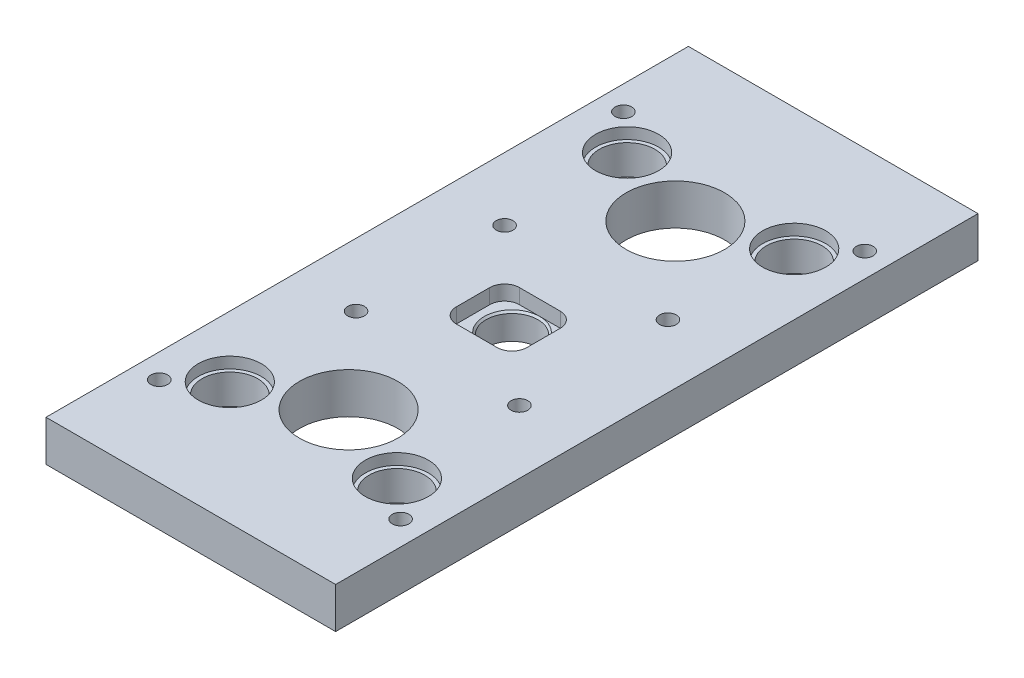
ISO-10303-21;
HEADER;
FILE_DESCRIPTION(('STEP AP214'),'2;1');
FILE_NAME('part.step','',(''),(''),'','','');
FILE_SCHEMA(('AUTOMOTIVE_DESIGN { 1 0 10303 214 1 1 1 1 }'));
ENDSEC;
DATA;
#1=APPLICATION_CONTEXT('core data for automotive mechanical design processes');
#2=APPLICATION_PROTOCOL_DEFINITION('international standard','automotive_design',2000,#1);
#3=PRODUCT_CONTEXT('',#1,'mechanical');
#4=PRODUCT('Part','Part','',(#3));
#5=PRODUCT_RELATED_PRODUCT_CATEGORY('part','',(#4));
#6=PRODUCT_DEFINITION_FORMATION('','',#4);
#7=PRODUCT_DEFINITION_CONTEXT('part definition',#1,'design');
#8=PRODUCT_DEFINITION('design','',#6,#7);
#9=PRODUCT_DEFINITION_SHAPE('','',#8);
#10=(LENGTH_UNIT() NAMED_UNIT(*) SI_UNIT(.MILLI.,.METRE.));
#11=(NAMED_UNIT(*) PLANE_ANGLE_UNIT() SI_UNIT($,.RADIAN.));
#12=(NAMED_UNIT(*) SI_UNIT($,.STERADIAN.) SOLID_ANGLE_UNIT());
#13=UNCERTAINTY_MEASURE_WITH_UNIT(LENGTH_MEASURE(1.E-05),#10,'distance_accuracy_value','');
#14=(GEOMETRIC_REPRESENTATION_CONTEXT(3) GLOBAL_UNCERTAINTY_ASSIGNED_CONTEXT((#13)) GLOBAL_UNIT_ASSIGNED_CONTEXT((#10,
#11,#12)) REPRESENTATION_CONTEXT('',''));
#15=CARTESIAN_POINT('',(0.,0.,0.));
#16=DIRECTION('',(0.,0.,1.));
#17=DIRECTION('',(1.,0.,0.));
#18=AXIS2_PLACEMENT_3D('',#15,#16,#17);
#19=CARTESIAN_POINT('',(-19.,-114.,84.));
#20=DIRECTION('',(0.,1.,0.));
#21=DIRECTION('',(1.,0.,0.));
#22=AXIS2_PLACEMENT_3D('',#19,#20,#21);
#23=PLANE('',#22);
#24=DIRECTION('',(0.,0.,-1.));
#25=VECTOR('',#24,1.);
#26=CARTESIAN_POINT('',(19.,-114.,67.));
#27=LINE('',#26,#25);
#28=CARTESIAN_POINT('',(19.,-114.,76.0000000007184));
#29=VERTEX_POINT('',#28);
#30=CARTESIAN_POINT('',(19.,-114.,58.));
#31=VERTEX_POINT('',#30);
#32=EDGE_CURVE('E343',#29,#31,#27,.T.);
#33=ORIENTED_EDGE('',*,*,#32,.T.);
#34=CARTESIAN_POINT('',(11.,-114.,58.));
#35=DIRECTION('',(0.,1.,0.));
#36=DIRECTION('',(0.,0.,1.));
#37=AXIS2_PLACEMENT_3D('',#34,#35,#36);
#38=CIRCLE('',#37,8.);
#39=CARTESIAN_POINT('',(10.9999999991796,-114.,50.));
#40=VERTEX_POINT('',#39);
#41=EDGE_CURVE('E342',#40,#31,#38,.F.);
#42=ORIENTED_EDGE('',*,*,#41,.F.);
#43=DIRECTION('',(-1.,0.,0.));
#44=VECTOR('',#43,1.);
#45=CARTESIAN_POINT('',(0.,-114.,50.));
#46=LINE('',#45,#44);
#47=CARTESIAN_POINT('',(-1.53827192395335E-09,-114.,50.));
#48=VERTEX_POINT('',#47);
#49=EDGE_CURVE('E136',#40,#48,#46,.T.);
#50=ORIENTED_EDGE('',*,*,#49,.T.);
#51=CARTESIAN_POINT('',(0.,-114.,65.));
#52=DIRECTION('',(0.,1.,0.));
#53=DIRECTION('',(0.,0.,1.));
#54=AXIS2_PLACEMENT_3D('',#51,#52,#53);
#55=CIRCLE('',#54,15.);
#56=EDGE_CURVE('E20',#48,#48,#55,.T.);
#57=ORIENTED_EDGE('',*,*,#56,.F.);
#58=DIRECTION('',(-1.,0.,0.));
#59=VECTOR('',#58,1.);
#60=CARTESIAN_POINT('',(0.,-114.,50.));
#61=LINE('',#60,#59);
#62=CARTESIAN_POINT('',(-11.,-114.,50.));
#63=VERTEX_POINT('',#62);
#64=EDGE_CURVE('E141',#48,#63,#61,.T.);
#65=ORIENTED_EDGE('',*,*,#64,.T.);
#66=CARTESIAN_POINT('',(-11.,-114.,58.));
#67=DIRECTION('',(0.,1.,0.));
#68=DIRECTION('',(0.,0.,1.));
#69=AXIS2_PLACEMENT_3D('',#66,#67,#68);
#70=CIRCLE('',#69,8.);
#71=CARTESIAN_POINT('',(-19.,-114.,58.0000000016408));
#72=VERTEX_POINT('',#71);
#73=EDGE_CURVE('E125',#72,#63,#70,.F.);
#74=ORIENTED_EDGE('',*,*,#73,.F.);
#75=DIRECTION('',(0.,0.,1.));
#76=VECTOR('',#75,1.);
#77=CARTESIAN_POINT('',(-19.,-114.,67.));
#78=LINE('',#77,#76);
#79=CARTESIAN_POINT('',(-19.,-114.,76.0000000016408));
#80=VERTEX_POINT('',#79);
#81=EDGE_CURVE('E348',#72,#80,#78,.T.);
#82=ORIENTED_EDGE('',*,*,#81,.T.);
#83=CARTESIAN_POINT('',(-11.,-114.,76.));
#84=DIRECTION('',(0.,1.,0.));
#85=DIRECTION('',(0.,0.,1.));
#86=AXIS2_PLACEMENT_3D('',#83,#84,#85);
#87=CIRCLE('',#86,8.);
#88=CARTESIAN_POINT('',(-11.0000000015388,-114.,84.));
#89=VERTEX_POINT('',#88);
#90=EDGE_CURVE('E335',#89,#80,#87,.F.);
#91=ORIENTED_EDGE('',*,*,#90,.F.);
#92=DIRECTION('',(1.,0.,0.));
#93=VECTOR('',#92,1.);
#94=CARTESIAN_POINT('',(0.,-114.,84.));
#95=LINE('',#94,#93);
#96=CARTESIAN_POINT('',(11.,-114.,84.));
#97=VERTEX_POINT('',#96);
#98=EDGE_CURVE('E340',#89,#97,#95,.T.);
#99=ORIENTED_EDGE('',*,*,#98,.T.);
#100=CARTESIAN_POINT('',(11.,-114.,76.));
#101=DIRECTION('',(0.,1.,0.));
#102=DIRECTION('',(0.,0.,1.));
#103=AXIS2_PLACEMENT_3D('',#100,#101,#102);
#104=CIRCLE('',#103,8.);
#105=EDGE_CURVE('E338',#29,#97,#104,.F.);
#106=ORIENTED_EDGE('',*,*,#105,.F.);
#107=EDGE_LOOP('',(#33,#42,#50,#57,#65,#74,#82,#91,#99,#106));
#108=FACE_BOUND('',#107,.T.);
#109=ADVANCED_FACE('F16',(#108),#23,.T.);
#110=CARTESIAN_POINT('',(62.204,-112.,-24.796));
#111=DIRECTION('',(0.,-1.,0.));
#112=DIRECTION('',(-1.,0.,0.));
#113=AXIS2_PLACEMENT_3D('',#110,#111,#112);
#114=PLANE('',#113);
#115=CARTESIAN_POINT('',(45.,-112.,-42.));
#116=DIRECTION('',(0.,-1.,0.));
#117=DIRECTION('',(0.,0.,-1.));
#118=AXIS2_PLACEMENT_3D('',#115,#116,#117);
#119=CIRCLE('',#118,15.);
#120=CARTESIAN_POINT('',(45.,-112.,-57.));
#121=VERTEX_POINT('',#120);
#122=EDGE_CURVE('E316',#121,#121,#119,.F.);
#123=ORIENTED_EDGE('',*,*,#122,.F.);
#124=EDGE_LOOP('',(#123));
#125=FACE_BOUND('',#124,.T.);
#126=CARTESIAN_POINT('',(45.,-112.,-42.));
#127=DIRECTION('',(0.,-1.,0.));
#128=DIRECTION('',(0.,0.,-1.));
#129=AXIS2_PLACEMENT_3D('',#126,#127,#128);
#130=CIRCLE('',#129,17.);
#131=CARTESIAN_POINT('',(45.,-112.,-59.));
#132=VERTEX_POINT('',#131);
#133=EDGE_CURVE('E363',#132,#132,#130,.T.);
#134=ORIENTED_EDGE('',*,*,#133,.F.);
#135=EDGE_LOOP('',(#134));
#136=FACE_BOUND('',#135,.T.);
#137=ADVANCED_FACE('F657',(#125,#136),#114,.F.);
#138=CARTESIAN_POINT('',(-62.204,-112.,-59.204));
#139=DIRECTION('',(0.,-1.,0.));
#140=DIRECTION('',(1.,0.,0.));
#141=AXIS2_PLACEMENT_3D('',#138,#139,#140);
#142=PLANE('',#141);
#143=CARTESIAN_POINT('',(-45.,-112.,-42.));
#144=DIRECTION('',(0.,-1.,0.));
#145=DIRECTION('',(0.,0.,-1.));
#146=AXIS2_PLACEMENT_3D('',#143,#144,#145);
#147=CIRCLE('',#146,15.);
#148=CARTESIAN_POINT('',(-45.,-112.,-57.));
#149=VERTEX_POINT('',#148);
#150=EDGE_CURVE('E313',#149,#149,#147,.F.);
#151=ORIENTED_EDGE('',*,*,#150,.F.);
#152=EDGE_LOOP('',(#151));
#153=FACE_BOUND('',#152,.T.);
#154=CARTESIAN_POINT('',(-45.,-112.,-42.));
#155=DIRECTION('',(0.,-1.,0.));
#156=DIRECTION('',(0.,0.,-1.));
#157=AXIS2_PLACEMENT_3D('',#154,#155,#156);
#158=CIRCLE('',#157,17.);
#159=CARTESIAN_POINT('',(-45.,-112.,-59.));
#160=VERTEX_POINT('',#159);
#161=EDGE_CURVE('E319',#160,#160,#158,.T.);
#162=ORIENTED_EDGE('',*,*,#161,.F.);
#163=EDGE_LOOP('',(#162));
#164=FACE_BOUND('',#163,.T.);
#165=ADVANCED_FACE('F660',(#153,#164),#142,.F.);
#166=CARTESIAN_POINT('',(62.204,-112.,189.204));
#167=DIRECTION('',(0.,-1.,0.));
#168=DIRECTION('',(-1.,0.,0.));
#169=AXIS2_PLACEMENT_3D('',#166,#167,#168);
#170=PLANE('',#169);
#171=CARTESIAN_POINT('',(45.,-112.,172.));
#172=DIRECTION('',(0.,-1.,0.));
#173=DIRECTION('',(0.,0.,-1.));
#174=AXIS2_PLACEMENT_3D('',#171,#172,#173);
#175=CIRCLE('',#174,15.);
#176=CARTESIAN_POINT('',(45.,-112.,157.));
#177=VERTEX_POINT('',#176);
#178=EDGE_CURVE('E310',#177,#177,#175,.F.);
#179=ORIENTED_EDGE('',*,*,#178,.F.);
#180=EDGE_LOOP('',(#179));
#181=FACE_BOUND('',#180,.T.);
#182=CARTESIAN_POINT('',(45.,-112.,172.));
#183=DIRECTION('',(0.,-1.,0.));
#184=DIRECTION('',(0.,0.,-1.));
#185=AXIS2_PLACEMENT_3D('',#182,#183,#184);
#186=CIRCLE('',#185,17.);
#187=CARTESIAN_POINT('',(45.,-112.,155.));
#188=VERTEX_POINT('',#187);
#189=EDGE_CURVE('E361',#188,#188,#186,.T.);
#190=ORIENTED_EDGE('',*,*,#189,.F.);
#191=EDGE_LOOP('',(#190));
#192=FACE_BOUND('',#191,.T.);
#193=ADVANCED_FACE('F664',(#181,#192),#170,.F.);
#194=CARTESIAN_POINT('',(-62.204,-112.,154.796));
#195=DIRECTION('',(0.,-1.,0.));
#196=DIRECTION('',(1.,0.,0.));
#197=AXIS2_PLACEMENT_3D('',#194,#195,#196);
#198=PLANE('',#197);
#199=CARTESIAN_POINT('',(-45.,-112.,172.));
#200=DIRECTION('',(0.,-1.,0.));
#201=DIRECTION('',(0.,0.,-1.));
#202=AXIS2_PLACEMENT_3D('',#199,#200,#201);
#203=CIRCLE('',#202,15.);
#204=CARTESIAN_POINT('',(-45.,-112.,157.));
#205=VERTEX_POINT('',#204);
#206=EDGE_CURVE('E307',#205,#205,#203,.F.);
#207=ORIENTED_EDGE('',*,*,#206,.F.);
#208=EDGE_LOOP('',(#207));
#209=FACE_BOUND('',#208,.T.);
#210=CARTESIAN_POINT('',(-45.,-112.,172.));
#211=DIRECTION('',(0.,-1.,0.));
#212=DIRECTION('',(0.,0.,-1.));
#213=AXIS2_PLACEMENT_3D('',#210,#211,#212);
#214=CIRCLE('',#213,17.);
#215=CARTESIAN_POINT('',(-45.,-112.,155.));
#216=VERTEX_POINT('',#215);
#217=EDGE_CURVE('E358',#216,#216,#214,.T.);
#218=ORIENTED_EDGE('',*,*,#217,.F.);
#219=EDGE_LOOP('',(#218));
#220=FACE_BOUND('',#219,.T.);
#221=ADVANCED_FACE('F668',(#209,#220),#198,.F.);
#222=CARTESIAN_POINT('',(57.916,-119.,-52.916));
#223=DIRECTION('',(0.,1.,0.));
#224=DIRECTION('',(1.,0.,0.));
#225=AXIS2_PLACEMENT_3D('',#222,#223,#224);
#226=PLANE('',#225);
#227=CARTESIAN_POINT('',(65.,-119.,-60.));
#228=DIRECTION('',(0.,-1.,0.));
#229=DIRECTION('',(0.,0.,-1.));
#230=AXIS2_PLACEMENT_3D('',#227,#228,#229);
#231=CIRCLE('',#230,4.5);
#232=CARTESIAN_POINT('',(65.,-119.,-64.5));
#233=VERTEX_POINT('',#232);
#234=EDGE_CURVE('E352',#233,#233,#231,.T.);
#235=ORIENTED_EDGE('',*,*,#234,.F.);
#236=EDGE_LOOP('',(#235));
#237=FACE_BOUND('',#236,.T.);
#238=CARTESIAN_POINT('',(65.,-119.,-60.));
#239=DIRECTION('',(0.,-1.,0.));
#240=DIRECTION('',(0.,0.,-1.));
#241=AXIS2_PLACEMENT_3D('',#238,#239,#240);
#242=CIRCLE('',#241,7.);
#243=CARTESIAN_POINT('',(65.,-119.,-67.));
#244=VERTEX_POINT('',#243);
#245=EDGE_CURVE('E304',#244,#244,#242,.F.);
#246=ORIENTED_EDGE('',*,*,#245,.F.);
#247=EDGE_LOOP('',(#246));
#248=FACE_BOUND('',#247,.T.);
#249=ADVANCED_FACE('F672',(#237,#248),#226,.F.);
#250=CARTESIAN_POINT('',(-72.084,-119.,197.084));
#251=DIRECTION('',(0.,1.,0.));
#252=DIRECTION('',(1.,0.,0.));
#253=AXIS2_PLACEMENT_3D('',#250,#251,#252);
#254=PLANE('',#253);
#255=CARTESIAN_POINT('',(-65.,-119.,190.));
#256=DIRECTION('',(0.,-1.,0.));
#257=DIRECTION('',(0.,0.,-1.));
#258=AXIS2_PLACEMENT_3D('',#255,#256,#257);
#259=CIRCLE('',#258,4.5);
#260=CARTESIAN_POINT('',(-65.,-119.,185.5));
#261=VERTEX_POINT('',#260);
#262=EDGE_CURVE('E345',#261,#261,#259,.T.);
#263=ORIENTED_EDGE('',*,*,#262,.F.);
#264=EDGE_LOOP('',(#263));
#265=FACE_BOUND('',#264,.T.);
#266=CARTESIAN_POINT('',(-65.,-119.,190.));
#267=DIRECTION('',(0.,-1.,0.));
#268=DIRECTION('',(0.,0.,-1.));
#269=AXIS2_PLACEMENT_3D('',#266,#267,#268);
#270=CIRCLE('',#269,7.00000000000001);
#271=CARTESIAN_POINT('',(-65.,-119.,183.));
#272=VERTEX_POINT('',#271);
#273=EDGE_CURVE('E300',#272,#272,#270,.F.);
#274=ORIENTED_EDGE('',*,*,#273,.F.);
#275=EDGE_LOOP('',(#274));
#276=FACE_BOUND('',#275,.T.);
#277=ADVANCED_FACE('F653',(#265,#276),#254,.F.);
#278=CARTESIAN_POINT('',(0.,-115.387564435,25.));
#279=DIRECTION('',(0.,-1.,0.));
#280=DIRECTION('',(0.,0.,-1.));
#281=AXIS2_PLACEMENT_3D('',#278,#279,#280);
#282=CONICAL_SURFACE('',#281,0.,1.04719755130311);
#283=CARTESIAN_POINT('',(0.,-115.387564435,25.));
#284=VERTEX_POINT('',#283);
#285=VERTEX_LOOP('',#284);
#286=FACE_BOUND('',#285,.T.);
#287=CARTESIAN_POINT('',(0.,-116.6,25.));
#288=DIRECTION('',(0.,-1.,0.));
#289=DIRECTION('',(-1.,0.,0.));
#290=AXIS2_PLACEMENT_3D('',#287,#288,#289);
#291=CIRCLE('',#290,2.1);
#292=CARTESIAN_POINT('',(-2.1,-116.6,25.));
#293=VERTEX_POINT('',#292);
#294=EDGE_CURVE('E303',#293,#293,#291,.F.);
#295=ORIENTED_EDGE('',*,*,#294,.F.);
#296=EDGE_LOOP('',(#295));
#297=FACE_BOUND('',#296,.T.);
#298=ADVANCED_FACE('F649',(#286,#297),#282,.F.);
#299=CARTESIAN_POINT('',(0.,-115.387564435,105.));
#300=DIRECTION('',(0.,-1.,0.));
#301=DIRECTION('',(0.,0.,-1.));
#302=AXIS2_PLACEMENT_3D('',#299,#300,#301);
#303=CONICAL_SURFACE('',#302,0.,1.04719755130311);
#304=CARTESIAN_POINT('',(0.,-115.387564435,105.));
#305=VERTEX_POINT('',#304);
#306=VERTEX_LOOP('',#305);
#307=FACE_BOUND('',#306,.T.);
#308=CARTESIAN_POINT('',(0.,-116.6,105.));
#309=DIRECTION('',(0.,-1.,0.));
#310=DIRECTION('',(-1.,0.,0.));
#311=AXIS2_PLACEMENT_3D('',#308,#309,#310);
#312=CIRCLE('',#311,2.1);
#313=CARTESIAN_POINT('',(-2.1,-116.6,105.));
#314=VERTEX_POINT('',#313);
#315=EDGE_CURVE('E390',#314,#314,#312,.F.);
#316=ORIENTED_EDGE('',*,*,#315,.F.);
#317=EDGE_LOOP('',(#316));
#318=FACE_BOUND('',#317,.T.);
#319=ADVANCED_FACE('F645',(#307,#318),#303,.F.);
#320=CARTESIAN_POINT('',(0.,-115.,65.));
#321=DIRECTION('',(0.,1.,0.));
#322=DIRECTION('',(0.,0.,1.));
#323=AXIS2_PLACEMENT_3D('',#320,#321,#322);
#324=CONICAL_SURFACE('',#323,14.,0.785398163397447);
#325=CARTESIAN_POINT('',(0.,-115.,65.));
#326=DIRECTION('',(0.,1.,0.));
#327=DIRECTION('',(1.,0.,0.));
#328=AXIS2_PLACEMENT_3D('',#325,#326,#327);
#329=CIRCLE('',#328,14.);
#330=CARTESIAN_POINT('',(14.,-115.,65.));
#331=VERTEX_POINT('',#330);
#332=EDGE_CURVE('E299',#331,#331,#329,.T.);
#333=ORIENTED_EDGE('',*,*,#332,.F.);
#334=EDGE_LOOP('',(#333));
#335=FACE_BOUND('',#334,.T.);
#336=ORIENTED_EDGE('',*,*,#56,.T.);
#337=EDGE_LOOP('',(#336));
#338=FACE_BOUND('',#337,.T.);
#339=ADVANCED_FACE('F368',(#335,#338),#324,.F.);
#340=CARTESIAN_POINT('',(36.916,-119.,32.084));
#341=DIRECTION('',(0.,1.,0.));
#342=DIRECTION('',(1.,0.,0.));
#343=AXIS2_PLACEMENT_3D('',#340,#341,#342);
#344=PLANE('',#343);
#345=CARTESIAN_POINT('',(44.,-119.,25.));
#346=DIRECTION('',(0.,-1.,0.));
#347=DIRECTION('',(0.,0.,-1.));
#348=AXIS2_PLACEMENT_3D('',#345,#346,#347);
#349=CIRCLE('',#348,4.5);
#350=CARTESIAN_POINT('',(44.,-119.,20.5));
#351=VERTEX_POINT('',#350);
#352=EDGE_CURVE('E328',#351,#351,#349,.T.);
#353=ORIENTED_EDGE('',*,*,#352,.F.);
#354=EDGE_LOOP('',(#353));
#355=FACE_BOUND('',#354,.T.);
#356=CARTESIAN_POINT('',(44.,-119.,25.));
#357=DIRECTION('',(0.,-1.,0.));
#358=DIRECTION('',(0.,0.,-1.));
#359=AXIS2_PLACEMENT_3D('',#356,#357,#358);
#360=CIRCLE('',#359,7.);
#361=CARTESIAN_POINT('',(44.,-119.,18.));
#362=VERTEX_POINT('',#361);
#363=EDGE_CURVE('E296',#362,#362,#360,.F.);
#364=ORIENTED_EDGE('',*,*,#363,.F.);
#365=EDGE_LOOP('',(#364));
#366=FACE_BOUND('',#365,.T.);
#367=ADVANCED_FACE('F644',(#355,#366),#344,.F.);
#368=CARTESIAN_POINT('',(-51.084,-119.,112.084));
#369=DIRECTION('',(0.,1.,0.));
#370=DIRECTION('',(1.,0.,0.));
#371=AXIS2_PLACEMENT_3D('',#368,#369,#370);
#372=PLANE('',#371);
#373=CARTESIAN_POINT('',(-44.,-119.,105.));
#374=DIRECTION('',(0.,-1.,0.));
#375=DIRECTION('',(0.,0.,-1.));
#376=AXIS2_PLACEMENT_3D('',#373,#374,#375);
#377=CIRCLE('',#376,4.5);
#378=CARTESIAN_POINT('',(-44.,-119.,100.5));
#379=VERTEX_POINT('',#378);
#380=EDGE_CURVE('E322',#379,#379,#377,.T.);
#381=ORIENTED_EDGE('',*,*,#380,.F.);
#382=EDGE_LOOP('',(#381));
#383=FACE_BOUND('',#382,.T.);
#384=CARTESIAN_POINT('',(-44.,-119.,105.));
#385=DIRECTION('',(0.,-1.,0.));
#386=DIRECTION('',(0.,0.,-1.));
#387=AXIS2_PLACEMENT_3D('',#384,#385,#386);
#388=CIRCLE('',#387,7.00000000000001);
#389=CARTESIAN_POINT('',(-44.,-119.,98.));
#390=VERTEX_POINT('',#389);
#391=EDGE_CURVE('E292',#390,#390,#388,.F.);
#392=ORIENTED_EDGE('',*,*,#391,.F.);
#393=EDGE_LOOP('',(#392));
#394=FACE_BOUND('',#393,.T.);
#395=ADVANCED_FACE('F640',(#383,#394),#372,.F.);
#396=CARTESIAN_POINT('',(-65.,-108.845299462,-95.));
#397=DIRECTION('',(0.,-1.,0.));
#398=DIRECTION('',(0.,0.,-1.));
#399=AXIS2_PLACEMENT_3D('',#396,#397,#398);
#400=CONICAL_SURFACE('',#399,0.,1.04719755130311);
#401=CARTESIAN_POINT('',(-65.,-108.845299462,-95.));
#402=VERTEX_POINT('',#401);
#403=VERTEX_LOOP('',#402);
#404=FACE_BOUND('',#403,.T.);
#405=CARTESIAN_POINT('',(-65.,-110.057735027,-95.));
#406=DIRECTION('',(0.,-1.,0.));
#407=DIRECTION('',(-1.,0.,0.));
#408=AXIS2_PLACEMENT_3D('',#405,#406,#407);
#409=CIRCLE('',#408,2.09999999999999);
#410=CARTESIAN_POINT('',(-67.1,-110.057735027,-95.));
#411=VERTEX_POINT('',#410);
#412=EDGE_CURVE('E295',#411,#411,#409,.F.);
#413=ORIENTED_EDGE('',*,*,#412,.F.);
#414=EDGE_LOOP('',(#413));
#415=FACE_BOUND('',#414,.T.);
#416=ADVANCED_FACE('F636',(#404,#415),#400,.F.);
#417=CARTESIAN_POINT('',(65.,-108.845299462,-95.));
#418=DIRECTION('',(0.,-1.,0.));
#419=DIRECTION('',(0.,0.,-1.));
#420=AXIS2_PLACEMENT_3D('',#417,#418,#419);
#421=CONICAL_SURFACE('',#420,0.,1.04719755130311);
#422=CARTESIAN_POINT('',(65.,-108.845299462,-95.));
#423=VERTEX_POINT('',#422);
#424=VERTEX_LOOP('',#423);
#425=FACE_BOUND('',#424,.T.);
#426=CARTESIAN_POINT('',(65.,-110.057735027,-95.));
#427=DIRECTION('',(0.,-1.,0.));
#428=DIRECTION('',(-1.,0.,0.));
#429=AXIS2_PLACEMENT_3D('',#426,#427,#428);
#430=CIRCLE('',#429,2.1);
#431=CARTESIAN_POINT('',(62.9,-110.057735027,-95.));
#432=VERTEX_POINT('',#431);
#433=EDGE_CURVE('E291',#432,#432,#430,.F.);
#434=ORIENTED_EDGE('',*,*,#433,.F.);
#435=EDGE_LOOP('',(#434));
#436=FACE_BOUND('',#435,.T.);
#437=ADVANCED_FACE('F633',(#425,#436),#421,.F.);
#438=CARTESIAN_POINT('',(62.8748,-110.,222.8748));
#439=DIRECTION('',(0.,1.,0.));
#440=DIRECTION('',(0.,0.,1.));
#441=AXIS2_PLACEMENT_3D('',#438,#439,#440);
#442=PLANE('',#441);
#443=CARTESIAN_POINT('',(65.,-110.,225.));
#444=DIRECTION('',(0.,-1.,0.));
#445=DIRECTION('',(0.,0.,-1.));
#446=AXIS2_PLACEMENT_3D('',#443,#444,#445);
#447=CIRCLE('',#446,2.1);
#448=CARTESIAN_POINT('',(65.,-110.,222.9));
#449=VERTEX_POINT('',#448);
#450=EDGE_CURVE('E288',#449,#449,#447,.F.);
#451=ORIENTED_EDGE('',*,*,#450,.F.);
#452=EDGE_LOOP('',(#451));
#453=FACE_BOUND('',#452,.T.);
#454=ADVANCED_FACE('F631',(#453),#442,.F.);
#455=CARTESIAN_POINT('',(-65.,-108.845299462,225.));
#456=DIRECTION('',(0.,-1.,0.));
#457=DIRECTION('',(0.,0.,-1.));
#458=AXIS2_PLACEMENT_3D('',#455,#456,#457);
#459=CONICAL_SURFACE('',#458,0.,1.04719755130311);
#460=CARTESIAN_POINT('',(-65.,-108.845299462,225.));
#461=VERTEX_POINT('',#460);
#462=VERTEX_LOOP('',#461);
#463=FACE_BOUND('',#462,.T.);
#464=CARTESIAN_POINT('',(-65.,-110.057735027,225.));
#465=DIRECTION('',(0.,-1.,0.));
#466=DIRECTION('',(-1.,0.,0.));
#467=AXIS2_PLACEMENT_3D('',#464,#465,#466);
#468=CIRCLE('',#467,2.09999999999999);
#469=CARTESIAN_POINT('',(-67.1,-110.057735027,225.));
#470=VERTEX_POINT('',#469);
#471=EDGE_CURVE('E287',#470,#470,#468,.F.);
#472=ORIENTED_EDGE('',*,*,#471,.F.);
#473=EDGE_LOOP('',(#472));
#474=FACE_BOUND('',#473,.T.);
#475=ADVANCED_FACE('F627',(#463,#474),#459,.F.);
#476=CARTESIAN_POINT('',(-51.084,-119.,32.084));
#477=DIRECTION('',(0.,1.,0.));
#478=DIRECTION('',(1.,0.,0.));
#479=AXIS2_PLACEMENT_3D('',#476,#477,#478);
#480=PLANE('',#479);
#481=CARTESIAN_POINT('',(-44.,-119.,25.));
#482=DIRECTION('',(0.,-1.,0.));
#483=DIRECTION('',(0.,0.,-1.));
#484=AXIS2_PLACEMENT_3D('',#481,#482,#483);
#485=CIRCLE('',#484,4.5);
#486=CARTESIAN_POINT('',(-44.,-119.,20.5));
#487=VERTEX_POINT('',#486);
#488=EDGE_CURVE('E325',#487,#487,#485,.T.);
#489=ORIENTED_EDGE('',*,*,#488,.F.);
#490=EDGE_LOOP('',(#489));
#491=FACE_BOUND('',#490,.T.);
#492=CARTESIAN_POINT('',(-44.,-119.,25.));
#493=DIRECTION('',(0.,-1.,0.));
#494=DIRECTION('',(0.,0.,-1.));
#495=AXIS2_PLACEMENT_3D('',#492,#493,#494);
#496=CIRCLE('',#495,7.00000000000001);
#497=CARTESIAN_POINT('',(-44.,-119.,18.));
#498=VERTEX_POINT('',#497);
#499=EDGE_CURVE('E284',#498,#498,#496,.F.);
#500=ORIENTED_EDGE('',*,*,#499,.F.);
#501=EDGE_LOOP('',(#500));
#502=FACE_BOUND('',#501,.T.);
#503=ADVANCED_FACE('F630',(#491,#502),#480,.F.);
#504=CARTESIAN_POINT('',(36.916,-119.,112.084));
#505=DIRECTION('',(0.,1.,0.));
#506=DIRECTION('',(1.,0.,0.));
#507=AXIS2_PLACEMENT_3D('',#504,#505,#506);
#508=PLANE('',#507);
#509=CARTESIAN_POINT('',(44.,-119.,105.));
#510=DIRECTION('',(0.,-1.,0.));
#511=DIRECTION('',(0.,0.,-1.));
#512=AXIS2_PLACEMENT_3D('',#509,#510,#511);
#513=CIRCLE('',#512,4.5);
#514=CARTESIAN_POINT('',(44.,-119.,100.5));
#515=VERTEX_POINT('',#514);
#516=EDGE_CURVE('E331',#515,#515,#513,.T.);
#517=ORIENTED_EDGE('',*,*,#516,.F.);
#518=EDGE_LOOP('',(#517));
#519=FACE_BOUND('',#518,.T.);
#520=CARTESIAN_POINT('',(44.,-119.,105.));
#521=DIRECTION('',(0.,-1.,0.));
#522=DIRECTION('',(0.,0.,-1.));
#523=AXIS2_PLACEMENT_3D('',#520,#521,#522);
#524=CIRCLE('',#523,7.);
#525=CARTESIAN_POINT('',(44.,-119.,98.));
#526=VERTEX_POINT('',#525);
#527=EDGE_CURVE('E281',#526,#526,#524,.F.);
#528=ORIENTED_EDGE('',*,*,#527,.F.);
#529=EDGE_LOOP('',(#528));
#530=FACE_BOUND('',#529,.T.);
#531=ADVANCED_FACE('F691',(#519,#530),#508,.F.);
#532=CARTESIAN_POINT('',(57.916,-119.,197.084));
#533=DIRECTION('',(0.,1.,0.));
#534=DIRECTION('',(1.,0.,0.));
#535=AXIS2_PLACEMENT_3D('',#532,#533,#534);
#536=PLANE('',#535);
#537=CARTESIAN_POINT('',(65.,-119.,190.));
#538=DIRECTION('',(0.,-1.,0.));
#539=DIRECTION('',(0.,0.,-1.));
#540=AXIS2_PLACEMENT_3D('',#537,#538,#539);
#541=CIRCLE('',#540,4.5);
#542=CARTESIAN_POINT('',(65.,-119.,185.5));
#543=VERTEX_POINT('',#542);
#544=EDGE_CURVE('E349',#543,#543,#541,.T.);
#545=ORIENTED_EDGE('',*,*,#544,.F.);
#546=EDGE_LOOP('',(#545));
#547=FACE_BOUND('',#546,.T.);
#548=CARTESIAN_POINT('',(65.,-119.,190.));
#549=DIRECTION('',(0.,-1.,0.));
#550=DIRECTION('',(0.,0.,-1.));
#551=AXIS2_PLACEMENT_3D('',#548,#549,#550);
#552=CIRCLE('',#551,7.);
#553=CARTESIAN_POINT('',(65.,-119.,183.));
#554=VERTEX_POINT('',#553);
#555=EDGE_CURVE('E278',#554,#554,#552,.F.);
#556=ORIENTED_EDGE('',*,*,#555,.F.);
#557=EDGE_LOOP('',(#556));
#558=FACE_BOUND('',#557,.T.);
#559=ADVANCED_FACE('F695',(#547,#558),#536,.F.);
#560=CARTESIAN_POINT('',(-72.084,-119.,-52.916));
#561=DIRECTION('',(0.,1.,0.));
#562=DIRECTION('',(1.,0.,0.));
#563=AXIS2_PLACEMENT_3D('',#560,#561,#562);
#564=PLANE('',#563);
#565=CARTESIAN_POINT('',(-65.,-119.,-60.));
#566=DIRECTION('',(0.,-1.,0.));
#567=DIRECTION('',(0.,0.,-1.));
#568=AXIS2_PLACEMENT_3D('',#565,#566,#567);
#569=CIRCLE('',#568,4.5);
#570=CARTESIAN_POINT('',(-65.,-119.,-64.5));
#571=VERTEX_POINT('',#570);
#572=EDGE_CURVE('E355',#571,#571,#569,.T.);
#573=ORIENTED_EDGE('',*,*,#572,.F.);
#574=EDGE_LOOP('',(#573));
#575=FACE_BOUND('',#574,.T.);
#576=CARTESIAN_POINT('',(-65.,-119.,-60.));
#577=DIRECTION('',(0.,-1.,0.));
#578=DIRECTION('',(0.,0.,-1.));
#579=AXIS2_PLACEMENT_3D('',#576,#577,#578);
#580=CIRCLE('',#579,7.00000000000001);
#581=CARTESIAN_POINT('',(-65.,-119.,-67.));
#582=VERTEX_POINT('',#581);
#583=EDGE_CURVE('E275',#582,#582,#580,.F.);
#584=ORIENTED_EDGE('',*,*,#583,.F.);
#585=EDGE_LOOP('',(#584));
#586=FACE_BOUND('',#585,.T.);
#587=ADVANCED_FACE('F625',(#575,#586),#564,.F.);
#588=CARTESIAN_POINT('',(45.,-106.,-42.));
#589=DIRECTION('',(0.,-1.,0.));
#590=DIRECTION('',(0.,0.,-1.));
#591=AXIS2_PLACEMENT_3D('',#588,#589,#590);
#592=CYLINDRICAL_SURFACE('',#591,17.);
#593=CARTESIAN_POINT('',(45.,-106.,-42.));
#594=DIRECTION('',(0.,-1.,0.));
#595=DIRECTION('',(0.,0.,-1.));
#596=AXIS2_PLACEMENT_3D('',#593,#594,#595);
#597=CIRCLE('',#596,17.);
#598=CARTESIAN_POINT('',(45.,-106.,-59.));
#599=VERTEX_POINT('',#598);
#600=EDGE_CURVE('E271',#599,#599,#597,.T.);
#601=ORIENTED_EDGE('',*,*,#600,.F.);
#602=EDGE_LOOP('',(#601));
#603=FACE_BOUND('',#602,.T.);
#604=ORIENTED_EDGE('',*,*,#133,.T.);
#605=EDGE_LOOP('',(#604));
#606=FACE_BOUND('',#605,.T.);
#607=ADVANCED_FACE('F621',(#603,#606),#592,.F.);
#608=CARTESIAN_POINT('',(45.,-106.,172.));
#609=DIRECTION('',(0.,-1.,0.));
#610=DIRECTION('',(0.,0.,-1.));
#611=AXIS2_PLACEMENT_3D('',#608,#609,#610);
#612=CYLINDRICAL_SURFACE('',#611,17.);
#613=ORIENTED_EDGE('',*,*,#189,.T.);
#614=EDGE_LOOP('',(#613));
#615=FACE_BOUND('',#614,.T.);
#616=CARTESIAN_POINT('',(45.,-106.,172.));
#617=DIRECTION('',(0.,-1.,0.));
#618=DIRECTION('',(0.,0.,-1.));
#619=AXIS2_PLACEMENT_3D('',#616,#617,#618);
#620=CIRCLE('',#619,17.);
#621=CARTESIAN_POINT('',(45.,-106.,155.));
#622=VERTEX_POINT('',#621);
#623=EDGE_CURVE('E268',#622,#622,#620,.T.);
#624=ORIENTED_EDGE('',*,*,#623,.F.);
#625=EDGE_LOOP('',(#624));
#626=FACE_BOUND('',#625,.T.);
#627=ADVANCED_FACE('F617',(#615,#626),#612,.F.);
#628=CARTESIAN_POINT('',(-45.,-106.,172.));
#629=DIRECTION('',(0.,-1.,0.));
#630=DIRECTION('',(0.,0.,-1.));
#631=AXIS2_PLACEMENT_3D('',#628,#629,#630);
#632=CYLINDRICAL_SURFACE('',#631,17.);
#633=CARTESIAN_POINT('',(-45.,-106.,172.));
#634=DIRECTION('',(0.,-1.,0.));
#635=DIRECTION('',(0.,0.,-1.));
#636=AXIS2_PLACEMENT_3D('',#633,#634,#635);
#637=CIRCLE('',#636,17.);
#638=CARTESIAN_POINT('',(-45.,-106.,155.));
#639=VERTEX_POINT('',#638);
#640=EDGE_CURVE('E265',#639,#639,#637,.T.);
#641=ORIENTED_EDGE('',*,*,#640,.F.);
#642=EDGE_LOOP('',(#641));
#643=FACE_BOUND('',#642,.T.);
#644=ORIENTED_EDGE('',*,*,#217,.T.);
#645=EDGE_LOOP('',(#644));
#646=FACE_BOUND('',#645,.T.);
#647=ADVANCED_FACE('F613',(#643,#646),#632,.F.);
#648=CARTESIAN_POINT('',(-65.,-106.,-60.));
#649=DIRECTION('',(0.,-1.,0.));
#650=DIRECTION('',(0.,0.,-1.));
#651=AXIS2_PLACEMENT_3D('',#648,#649,#650);
#652=CYLINDRICAL_SURFACE('',#651,4.5);
#653=CARTESIAN_POINT('',(-65.,-106.,-60.));
#654=DIRECTION('',(0.,-1.,0.));
#655=DIRECTION('',(0.,0.,-1.));
#656=AXIS2_PLACEMENT_3D('',#653,#654,#655);
#657=CIRCLE('',#656,4.5);
#658=CARTESIAN_POINT('',(-65.,-106.,-64.5));
#659=VERTEX_POINT('',#658);
#660=EDGE_CURVE('E262',#659,#659,#657,.T.);
#661=ORIENTED_EDGE('',*,*,#660,.F.);
#662=EDGE_LOOP('',(#661));
#663=FACE_BOUND('',#662,.T.);
#664=ORIENTED_EDGE('',*,*,#572,.T.);
#665=EDGE_LOOP('',(#664));
#666=FACE_BOUND('',#665,.T.);
#667=ADVANCED_FACE('F609',(#663,#666),#652,.F.);
#668=CARTESIAN_POINT('',(65.,-106.,-60.));
#669=DIRECTION('',(0.,-1.,0.));
#670=DIRECTION('',(0.,0.,-1.));
#671=AXIS2_PLACEMENT_3D('',#668,#669,#670);
#672=CYLINDRICAL_SURFACE('',#671,4.5);
#673=CARTESIAN_POINT('',(65.,-106.,-60.));
#674=DIRECTION('',(0.,-1.,0.));
#675=DIRECTION('',(0.,0.,-1.));
#676=AXIS2_PLACEMENT_3D('',#673,#674,#675);
#677=CIRCLE('',#676,4.5);
#678=CARTESIAN_POINT('',(65.,-106.,-64.5));
#679=VERTEX_POINT('',#678);
#680=EDGE_CURVE('E259',#679,#679,#677,.T.);
#681=ORIENTED_EDGE('',*,*,#680,.F.);
#682=EDGE_LOOP('',(#681));
#683=FACE_BOUND('',#682,.T.);
#684=ORIENTED_EDGE('',*,*,#234,.T.);
#685=EDGE_LOOP('',(#684));
#686=FACE_BOUND('',#685,.T.);
#687=ADVANCED_FACE('F605',(#683,#686),#672,.F.);
#688=CARTESIAN_POINT('',(65.,-106.,190.));
#689=DIRECTION('',(0.,-1.,0.));
#690=DIRECTION('',(0.,0.,-1.));
#691=AXIS2_PLACEMENT_3D('',#688,#689,#690);
#692=CYLINDRICAL_SURFACE('',#691,4.5);
#693=CARTESIAN_POINT('',(65.,-106.,190.));
#694=DIRECTION('',(0.,-1.,0.));
#695=DIRECTION('',(0.,0.,-1.));
#696=AXIS2_PLACEMENT_3D('',#693,#694,#695);
#697=CIRCLE('',#696,4.5);
#698=CARTESIAN_POINT('',(65.,-106.,185.5));
#699=VERTEX_POINT('',#698);
#700=EDGE_CURVE('E256',#699,#699,#697,.T.);
#701=ORIENTED_EDGE('',*,*,#700,.F.);
#702=EDGE_LOOP('',(#701));
#703=FACE_BOUND('',#702,.T.);
#704=ORIENTED_EDGE('',*,*,#544,.T.);
#705=EDGE_LOOP('',(#704));
#706=FACE_BOUND('',#705,.T.);
#707=ADVANCED_FACE('F601',(#703,#706),#692,.F.);
#708=CARTESIAN_POINT('',(-65.,-106.,190.));
#709=DIRECTION('',(0.,-1.,0.));
#710=DIRECTION('',(0.,0.,-1.));
#711=AXIS2_PLACEMENT_3D('',#708,#709,#710);
#712=CYLINDRICAL_SURFACE('',#711,4.5);
#713=CARTESIAN_POINT('',(-65.,-106.,190.));
#714=DIRECTION('',(0.,-1.,0.));
#715=DIRECTION('',(0.,0.,-1.));
#716=AXIS2_PLACEMENT_3D('',#713,#714,#715);
#717=CIRCLE('',#716,4.5);
#718=CARTESIAN_POINT('',(-65.,-106.,185.5));
#719=VERTEX_POINT('',#718);
#720=EDGE_CURVE('E253',#719,#719,#717,.T.);
#721=ORIENTED_EDGE('',*,*,#720,.F.);
#722=EDGE_LOOP('',(#721));
#723=FACE_BOUND('',#722,.T.);
#724=ORIENTED_EDGE('',*,*,#262,.T.);
#725=EDGE_LOOP('',(#724));
#726=FACE_BOUND('',#725,.T.);
#727=ADVANCED_FACE('F598',(#723,#726),#712,.F.);
#728=CARTESIAN_POINT('',(-19.,-106.,76.));
#729=DIRECTION('',(-1.,0.,0.));
#730=DIRECTION('',(0.,0.,-1.));
#731=AXIS2_PLACEMENT_3D('',#728,#729,#730);
#732=PLANE('',#731);
#733=DIRECTION('',(0.,-1.,0.));
#734=VECTOR('',#733,1.);
#735=CARTESIAN_POINT('',(-19.,-110.,76.0000000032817));
#736=LINE('',#735,#734);
#737=CARTESIAN_POINT('',(-19.000000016,-106.,76.0000000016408));
#738=VERTEX_POINT('',#737);
#739=EDGE_CURVE('E334',#80,#738,#736,.F.);
#740=ORIENTED_EDGE('',*,*,#739,.F.);
#741=ORIENTED_EDGE('',*,*,#81,.F.);
#742=DIRECTION('',(0.,1.,0.));
#743=VECTOR('',#742,1.);
#744=CARTESIAN_POINT('',(-19.,-110.,58.0000000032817));
#745=LINE('',#744,#743);
#746=CARTESIAN_POINT('',(-19.000000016,-106.,58.0000000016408));
#747=VERTEX_POINT('',#746);
#748=EDGE_CURVE('E132',#747,#72,#745,.F.);
#749=ORIENTED_EDGE('',*,*,#748,.F.);
#750=DIRECTION('',(0.,0.,-1.));
#751=VECTOR('',#750,1.);
#752=CARTESIAN_POINT('',(-19.000000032,-106.,65.));
#753=LINE('',#752,#751);
#754=EDGE_CURVE('E252',#738,#747,#753,.T.);
#755=ORIENTED_EDGE('',*,*,#754,.F.);
#756=EDGE_LOOP('',(#740,#741,#749,#755));
#757=FACE_BOUND('',#756,.T.);
#758=ADVANCED_FACE('F597',(#757),#732,.F.);
#759=CARTESIAN_POINT('',(-11.,-114.,58.));
#760=DIRECTION('',(0.,1.,0.));
#761=DIRECTION('',(0.,0.,1.));
#762=AXIS2_PLACEMENT_3D('',#759,#760,#761);
#763=CYLINDRICAL_SURFACE('',#762,8.);
#764=ORIENTED_EDGE('',*,*,#73,.T.);
#765=DIRECTION('',(0.,1.,0.));
#766=VECTOR('',#765,1.);
#767=CARTESIAN_POINT('',(-11.,-110.,50.));
#768=LINE('',#767,#766);
#769=CARTESIAN_POINT('',(-11.,-106.,50.000000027));
#770=VERTEX_POINT('',#769);
#771=EDGE_CURVE('E129',#63,#770,#768,.T.);
#772=ORIENTED_EDGE('',*,*,#771,.T.);
#773=CARTESIAN_POINT('',(-11.,-106.,58.));
#774=DIRECTION('',(0.,1.,0.));
#775=DIRECTION('',(0.,0.,1.));
#776=AXIS2_PLACEMENT_3D('',#773,#774,#775);
#777=CIRCLE('',#776,8.);
#778=EDGE_CURVE('E250',#747,#770,#777,.F.);
#779=ORIENTED_EDGE('',*,*,#778,.F.);
#780=ORIENTED_EDGE('',*,*,#748,.T.);
#781=EDGE_LOOP('',(#764,#772,#779,#780));
#782=FACE_BOUND('',#781,.T.);
#783=ADVANCED_FACE('F127',(#782),#763,.F.);
#784=CARTESIAN_POINT('',(-11.,-106.,50.));
#785=DIRECTION('',(0.,0.,-1.));
#786=DIRECTION('',(1.,0.,0.));
#787=AXIS2_PLACEMENT_3D('',#784,#785,#786);
#788=PLANE('',#787);
#789=ORIENTED_EDGE('',*,*,#771,.F.);
#790=ORIENTED_EDGE('',*,*,#64,.F.);
#791=ORIENTED_EDGE('',*,*,#49,.F.);
#792=DIRECTION('',(0.,1.,0.));
#793=VECTOR('',#792,1.);
#794=CARTESIAN_POINT('',(10.9999999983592,-110.,50.));
#795=LINE('',#794,#793);
#796=CARTESIAN_POINT('',(10.9999999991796,-106.,50.000000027));
#797=VERTEX_POINT('',#796);
#798=EDGE_CURVE('E145',#797,#40,#795,.F.);
#799=ORIENTED_EDGE('',*,*,#798,.F.);
#800=DIRECTION('',(1.,0.,0.));
#801=VECTOR('',#800,1.);
#802=CARTESIAN_POINT('',(0.,-106.,50.000000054));
#803=LINE('',#802,#801);
#804=EDGE_CURVE('E144',#770,#797,#803,.T.);
#805=ORIENTED_EDGE('',*,*,#804,.F.);
#806=EDGE_LOOP('',(#789,#790,#791,#799,#805));
#807=FACE_BOUND('',#806,.T.);
#808=ADVANCED_FACE('F140',(#807),#788,.F.);
#809=CARTESIAN_POINT('',(11.,-114.,58.));
#810=DIRECTION('',(0.,1.,0.));
#811=DIRECTION('',(0.,0.,1.));
#812=AXIS2_PLACEMENT_3D('',#809,#810,#811);
#813=CYLINDRICAL_SURFACE('',#812,8.);
#814=ORIENTED_EDGE('',*,*,#41,.T.);
#815=DIRECTION('',(0.,1.,0.));
#816=VECTOR('',#815,1.);
#817=CARTESIAN_POINT('',(19.,-110.,58.));
#818=LINE('',#817,#816);
#819=CARTESIAN_POINT('',(19.000000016,-106.,58.));
#820=VERTEX_POINT('',#819);
#821=EDGE_CURVE('E378',#31,#820,#818,.T.);
#822=ORIENTED_EDGE('',*,*,#821,.T.);
#823=CARTESIAN_POINT('',(11.,-106.,58.));
#824=DIRECTION('',(0.,1.,0.));
#825=DIRECTION('',(0.,0.,1.));
#826=AXIS2_PLACEMENT_3D('',#823,#824,#825);
#827=CIRCLE('',#826,8.);
#828=EDGE_CURVE('E248',#797,#820,#827,.F.);
#829=ORIENTED_EDGE('',*,*,#828,.F.);
#830=ORIENTED_EDGE('',*,*,#798,.T.);
#831=EDGE_LOOP('',(#814,#822,#829,#830));
#832=FACE_BOUND('',#831,.T.);
#833=ADVANCED_FACE('F373',(#832),#813,.F.);
#834=CARTESIAN_POINT('',(19.,-106.,58.));
#835=DIRECTION('',(1.,0.,0.));
#836=DIRECTION('',(0.,0.,1.));
#837=AXIS2_PLACEMENT_3D('',#834,#835,#836);
#838=PLANE('',#837);
#839=ORIENTED_EDGE('',*,*,#821,.F.);
#840=ORIENTED_EDGE('',*,*,#32,.F.);
#841=DIRECTION('',(0.,1.,0.));
#842=VECTOR('',#841,1.);
#843=CARTESIAN_POINT('',(19.,-110.,76.0000000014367));
#844=LINE('',#843,#842);
#845=CARTESIAN_POINT('',(19.000000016,-106.,76.0000000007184));
#846=VERTEX_POINT('',#845);
#847=EDGE_CURVE('E341',#846,#29,#844,.F.);
#848=ORIENTED_EDGE('',*,*,#847,.F.);
#849=DIRECTION('',(0.,0.,1.));
#850=VECTOR('',#849,1.);
#851=CARTESIAN_POINT('',(19.000000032,-106.,65.));
#852=LINE('',#851,#850);
#853=EDGE_CURVE('E247',#820,#846,#852,.T.);
#854=ORIENTED_EDGE('',*,*,#853,.F.);
#855=EDGE_LOOP('',(#839,#840,#848,#854));
#856=FACE_BOUND('',#855,.T.);
#857=ADVANCED_FACE('F592',(#856),#838,.F.);
#858=CARTESIAN_POINT('',(11.,-114.,76.));
#859=DIRECTION('',(0.,1.,0.));
#860=DIRECTION('',(0.,0.,1.));
#861=AXIS2_PLACEMENT_3D('',#858,#859,#860);
#862=CYLINDRICAL_SURFACE('',#861,8.);
#863=ORIENTED_EDGE('',*,*,#105,.T.);
#864=DIRECTION('',(0.,1.,0.));
#865=VECTOR('',#864,1.);
#866=CARTESIAN_POINT('',(11.,-110.,84.));
#867=LINE('',#866,#865);
#868=CARTESIAN_POINT('',(11.,-106.,84.000000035));
#869=VERTEX_POINT('',#868);
#870=EDGE_CURVE('E397',#97,#869,#867,.T.);
#871=ORIENTED_EDGE('',*,*,#870,.T.);
#872=CARTESIAN_POINT('',(11.,-106.,76.));
#873=DIRECTION('',(0.,1.,0.));
#874=DIRECTION('',(0.,0.,1.));
#875=AXIS2_PLACEMENT_3D('',#872,#873,#874);
#876=CIRCLE('',#875,8.);
#877=EDGE_CURVE('E245',#846,#869,#876,.F.);
#878=ORIENTED_EDGE('',*,*,#877,.F.);
#879=ORIENTED_EDGE('',*,*,#847,.T.);
#880=EDGE_LOOP('',(#863,#871,#878,#879));
#881=FACE_BOUND('',#880,.T.);
#882=ADVANCED_FACE('F589',(#881),#862,.F.);
#883=CARTESIAN_POINT('',(11.,-106.,84.));
#884=DIRECTION('',(0.,0.,1.));
#885=DIRECTION('',(-1.,0.,0.));
#886=AXIS2_PLACEMENT_3D('',#883,#884,#885);
#887=PLANE('',#886);
#888=ORIENTED_EDGE('',*,*,#870,.F.);
#889=ORIENTED_EDGE('',*,*,#98,.F.);
#890=DIRECTION('',(0.,1.,0.));
#891=VECTOR('',#890,1.);
#892=CARTESIAN_POINT('',(-11.0000000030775,-110.,84.));
#893=LINE('',#892,#891);
#894=CARTESIAN_POINT('',(-11.0000000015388,-106.,84.000000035));
#895=VERTEX_POINT('',#894);
#896=EDGE_CURVE('E337',#895,#89,#893,.F.);
#897=ORIENTED_EDGE('',*,*,#896,.F.);
#898=DIRECTION('',(-1.,0.,0.));
#899=VECTOR('',#898,1.);
#900=CARTESIAN_POINT('',(0.,-106.,84.00000007));
#901=LINE('',#900,#899);
#902=EDGE_CURVE('E244',#869,#895,#901,.T.);
#903=ORIENTED_EDGE('',*,*,#902,.F.);
#904=EDGE_LOOP('',(#888,#889,#897,#903));
#905=FACE_BOUND('',#904,.T.);
#906=ADVANCED_FACE('F587',(#905),#887,.F.);
#907=CARTESIAN_POINT('',(-11.,-114.,76.));
#908=DIRECTION('',(0.,1.,0.));
#909=DIRECTION('',(0.,0.,1.));
#910=AXIS2_PLACEMENT_3D('',#907,#908,#909);
#911=CYLINDRICAL_SURFACE('',#910,8.);
#912=ORIENTED_EDGE('',*,*,#90,.T.);
#913=ORIENTED_EDGE('',*,*,#739,.T.);
#914=CARTESIAN_POINT('',(-11.,-106.,76.));
#915=DIRECTION('',(0.,1.,0.));
#916=DIRECTION('',(0.,0.,1.));
#917=AXIS2_PLACEMENT_3D('',#914,#915,#916);
#918=CIRCLE('',#917,8.);
#919=EDGE_CURVE('E241',#895,#738,#918,.F.);
#920=ORIENTED_EDGE('',*,*,#919,.F.);
#921=ORIENTED_EDGE('',*,*,#896,.T.);
#922=EDGE_LOOP('',(#912,#913,#920,#921));
#923=FACE_BOUND('',#922,.T.);
#924=ADVANCED_FACE('F583',(#923),#911,.F.);
#925=CARTESIAN_POINT('',(44.,-106.,105.));
#926=DIRECTION('',(0.,-1.,0.));
#927=DIRECTION('',(0.,0.,-1.));
#928=AXIS2_PLACEMENT_3D('',#925,#926,#927);
#929=CYLINDRICAL_SURFACE('',#928,4.5);
#930=CARTESIAN_POINT('',(44.,-106.,105.));
#931=DIRECTION('',(0.,-1.,0.));
#932=DIRECTION('',(0.,0.,-1.));
#933=AXIS2_PLACEMENT_3D('',#930,#931,#932);
#934=CIRCLE('',#933,4.5);
#935=CARTESIAN_POINT('',(44.,-106.,100.5));
#936=VERTEX_POINT('',#935);
#937=EDGE_CURVE('E238',#936,#936,#934,.T.);
#938=ORIENTED_EDGE('',*,*,#937,.F.);
#939=EDGE_LOOP('',(#938));
#940=FACE_BOUND('',#939,.T.);
#941=ORIENTED_EDGE('',*,*,#516,.T.);
#942=EDGE_LOOP('',(#941));
#943=FACE_BOUND('',#942,.T.);
#944=ADVANCED_FACE('F579',(#940,#943),#929,.F.);
#945=CARTESIAN_POINT('',(44.,-106.,25.));
#946=DIRECTION('',(0.,-1.,0.));
#947=DIRECTION('',(0.,0.,-1.));
#948=AXIS2_PLACEMENT_3D('',#945,#946,#947);
#949=CYLINDRICAL_SURFACE('',#948,4.5);
#950=CARTESIAN_POINT('',(44.,-106.,25.));
#951=DIRECTION('',(0.,-1.,0.));
#952=DIRECTION('',(0.,0.,-1.));
#953=AXIS2_PLACEMENT_3D('',#950,#951,#952);
#954=CIRCLE('',#953,4.5);
#955=CARTESIAN_POINT('',(44.,-106.,20.5));
#956=VERTEX_POINT('',#955);
#957=EDGE_CURVE('E235',#956,#956,#954,.T.);
#958=ORIENTED_EDGE('',*,*,#957,.F.);
#959=EDGE_LOOP('',(#958));
#960=FACE_BOUND('',#959,.T.);
#961=ORIENTED_EDGE('',*,*,#352,.T.);
#962=EDGE_LOOP('',(#961));
#963=FACE_BOUND('',#962,.T.);
#964=ADVANCED_FACE('F575',(#960,#963),#949,.F.);
#965=CARTESIAN_POINT('',(-44.,-106.,25.));
#966=DIRECTION('',(0.,-1.,0.));
#967=DIRECTION('',(0.,0.,-1.));
#968=AXIS2_PLACEMENT_3D('',#965,#966,#967);
#969=CYLINDRICAL_SURFACE('',#968,4.5);
#970=CARTESIAN_POINT('',(-44.,-106.,25.));
#971=DIRECTION('',(0.,-1.,0.));
#972=DIRECTION('',(0.,0.,-1.));
#973=AXIS2_PLACEMENT_3D('',#970,#971,#972);
#974=CIRCLE('',#973,4.5);
#975=CARTESIAN_POINT('',(-44.,-106.,20.5));
#976=VERTEX_POINT('',#975);
#977=EDGE_CURVE('E232',#976,#976,#974,.T.);
#978=ORIENTED_EDGE('',*,*,#977,.F.);
#979=EDGE_LOOP('',(#978));
#980=FACE_BOUND('',#979,.T.);
#981=ORIENTED_EDGE('',*,*,#488,.T.);
#982=EDGE_LOOP('',(#981));
#983=FACE_BOUND('',#982,.T.);
#984=ADVANCED_FACE('F571',(#980,#983),#969,.F.);
#985=CARTESIAN_POINT('',(-44.,-106.,105.));
#986=DIRECTION('',(0.,-1.,0.));
#987=DIRECTION('',(0.,0.,-1.));
#988=AXIS2_PLACEMENT_3D('',#985,#986,#987);
#989=CYLINDRICAL_SURFACE('',#988,4.5);
#990=CARTESIAN_POINT('',(-44.,-106.,105.));
#991=DIRECTION('',(0.,-1.,0.));
#992=DIRECTION('',(0.,0.,-1.));
#993=AXIS2_PLACEMENT_3D('',#990,#991,#992);
#994=CIRCLE('',#993,4.5);
#995=CARTESIAN_POINT('',(-44.,-106.,100.5));
#996=VERTEX_POINT('',#995);
#997=EDGE_CURVE('E229',#996,#996,#994,.T.);
#998=ORIENTED_EDGE('',*,*,#997,.F.);
#999=EDGE_LOOP('',(#998));
#1000=FACE_BOUND('',#999,.T.);
#1001=ORIENTED_EDGE('',*,*,#380,.T.);
#1002=EDGE_LOOP('',(#1001));
#1003=FACE_BOUND('',#1002,.T.);
#1004=ADVANCED_FACE('F567',(#1000,#1003),#989,.F.);
#1005=CARTESIAN_POINT('',(-45.,-106.,-42.));
#1006=DIRECTION('',(0.,-1.,0.));
#1007=DIRECTION('',(0.,0.,-1.));
#1008=AXIS2_PLACEMENT_3D('',#1005,#1006,#1007);
#1009=CYLINDRICAL_SURFACE('',#1008,17.);
#1010=ORIENTED_EDGE('',*,*,#161,.T.);
#1011=EDGE_LOOP('',(#1010));
#1012=FACE_BOUND('',#1011,.T.);
#1013=CARTESIAN_POINT('',(-45.,-106.,-42.));
#1014=DIRECTION('',(0.,-1.,0.));
#1015=DIRECTION('',(0.,0.,-1.));
#1016=AXIS2_PLACEMENT_3D('',#1013,#1014,#1015);
#1017=CIRCLE('',#1016,17.);
#1018=CARTESIAN_POINT('',(-45.,-106.,-59.));
#1019=VERTEX_POINT('',#1018);
#1020=EDGE_CURVE('E219',#1019,#1019,#1017,.T.);
#1021=ORIENTED_EDGE('',*,*,#1020,.F.);
#1022=EDGE_LOOP('',(#1021));
#1023=FACE_BOUND('',#1022,.T.);
#1024=ADVANCED_FACE('F563',(#1012,#1023),#1009,.F.);
#1025=CARTESIAN_POINT('',(45.,-112.,-42.));
#1026=DIRECTION('',(0.,-1.,0.));
#1027=DIRECTION('',(0.,0.,-1.));
#1028=AXIS2_PLACEMENT_3D('',#1025,#1026,#1027);
#1029=CYLINDRICAL_SURFACE('',#1028,15.);
#1030=CARTESIAN_POINT('',(45.,-128.,-42.));
#1031=DIRECTION('',(0.,-1.,0.));
#1032=DIRECTION('',(0.,0.,-1.));
#1033=AXIS2_PLACEMENT_3D('',#1030,#1031,#1032);
#1034=CIRCLE('',#1033,15.);
#1035=CARTESIAN_POINT('',(45.,-128.,-57.));
#1036=VERTEX_POINT('',#1035);
#1037=EDGE_CURVE('E215',#1036,#1036,#1034,.F.);
#1038=ORIENTED_EDGE('',*,*,#1037,.F.);
#1039=EDGE_LOOP('',(#1038));
#1040=FACE_BOUND('',#1039,.T.);
#1041=ORIENTED_EDGE('',*,*,#122,.T.);
#1042=EDGE_LOOP('',(#1041));
#1043=FACE_BOUND('',#1042,.T.);
#1044=ADVANCED_FACE('F559',(#1040,#1043),#1029,.F.);
#1045=CARTESIAN_POINT('',(-45.,-112.,-42.));
#1046=DIRECTION('',(0.,-1.,0.));
#1047=DIRECTION('',(0.,0.,-1.));
#1048=AXIS2_PLACEMENT_3D('',#1045,#1046,#1047);
#1049=CYLINDRICAL_SURFACE('',#1048,15.);
#1050=CARTESIAN_POINT('',(-45.,-128.,-42.));
#1051=DIRECTION('',(0.,-1.,0.));
#1052=DIRECTION('',(0.,0.,-1.));
#1053=AXIS2_PLACEMENT_3D('',#1050,#1051,#1052);
#1054=CIRCLE('',#1053,15.);
#1055=CARTESIAN_POINT('',(-45.,-128.,-57.));
#1056=VERTEX_POINT('',#1055);
#1057=EDGE_CURVE('E212',#1056,#1056,#1054,.F.);
#1058=ORIENTED_EDGE('',*,*,#1057,.F.);
#1059=EDGE_LOOP('',(#1058));
#1060=FACE_BOUND('',#1059,.T.);
#1061=ORIENTED_EDGE('',*,*,#150,.T.);
#1062=EDGE_LOOP('',(#1061));
#1063=FACE_BOUND('',#1062,.T.);
#1064=ADVANCED_FACE('F555',(#1060,#1063),#1049,.F.);
#1065=CARTESIAN_POINT('',(45.,-112.,172.));
#1066=DIRECTION('',(0.,-1.,0.));
#1067=DIRECTION('',(0.,0.,-1.));
#1068=AXIS2_PLACEMENT_3D('',#1065,#1066,#1067);
#1069=CYLINDRICAL_SURFACE('',#1068,15.);
#1070=CARTESIAN_POINT('',(45.,-128.,172.));
#1071=DIRECTION('',(0.,-1.,0.));
#1072=DIRECTION('',(0.,0.,-1.));
#1073=AXIS2_PLACEMENT_3D('',#1070,#1071,#1072);
#1074=CIRCLE('',#1073,15.);
#1075=CARTESIAN_POINT('',(45.,-128.,157.));
#1076=VERTEX_POINT('',#1075);
#1077=EDGE_CURVE('E209',#1076,#1076,#1074,.F.);
#1078=ORIENTED_EDGE('',*,*,#1077,.F.);
#1079=EDGE_LOOP('',(#1078));
#1080=FACE_BOUND('',#1079,.T.);
#1081=ORIENTED_EDGE('',*,*,#178,.T.);
#1082=EDGE_LOOP('',(#1081));
#1083=FACE_BOUND('',#1082,.T.);
#1084=ADVANCED_FACE('F551',(#1080,#1083),#1069,.F.);
#1085=CARTESIAN_POINT('',(-45.,-112.,172.));
#1086=DIRECTION('',(0.,-1.,0.));
#1087=DIRECTION('',(0.,0.,-1.));
#1088=AXIS2_PLACEMENT_3D('',#1085,#1086,#1087);
#1089=CYLINDRICAL_SURFACE('',#1088,15.);
#1090=CARTESIAN_POINT('',(-45.,-128.,172.));
#1091=DIRECTION('',(0.,-1.,0.));
#1092=DIRECTION('',(0.,0.,-1.));
#1093=AXIS2_PLACEMENT_3D('',#1090,#1091,#1092);
#1094=CIRCLE('',#1093,15.);
#1095=CARTESIAN_POINT('',(-45.,-128.,157.));
#1096=VERTEX_POINT('',#1095);
#1097=EDGE_CURVE('E206',#1096,#1096,#1094,.F.);
#1098=ORIENTED_EDGE('',*,*,#1097,.F.);
#1099=EDGE_LOOP('',(#1098));
#1100=FACE_BOUND('',#1099,.T.);
#1101=ORIENTED_EDGE('',*,*,#206,.T.);
#1102=EDGE_LOOP('',(#1101));
#1103=FACE_BOUND('',#1102,.T.);
#1104=ADVANCED_FACE('F547',(#1100,#1103),#1089,.F.);
#1105=CARTESIAN_POINT('',(65.,-119.,-60.));
#1106=DIRECTION('',(0.,-1.,0.));
#1107=DIRECTION('',(0.,0.,-1.));
#1108=AXIS2_PLACEMENT_3D('',#1105,#1106,#1107);
#1109=CYLINDRICAL_SURFACE('',#1108,7.);
#1110=ORIENTED_EDGE('',*,*,#245,.T.);
#1111=EDGE_LOOP('',(#1110));
#1112=FACE_BOUND('',#1111,.T.);
#1113=CARTESIAN_POINT('',(65.,-128.,-60.));
#1114=DIRECTION('',(0.,-1.,0.));
#1115=DIRECTION('',(0.,0.,-1.));
#1116=AXIS2_PLACEMENT_3D('',#1113,#1114,#1115);
#1117=CIRCLE('',#1116,7.);
#1118=CARTESIAN_POINT('',(65.,-128.,-67.));
#1119=VERTEX_POINT('',#1118);
#1120=EDGE_CURVE('E203',#1119,#1119,#1117,.F.);
#1121=ORIENTED_EDGE('',*,*,#1120,.F.);
#1122=EDGE_LOOP('',(#1121));
#1123=FACE_BOUND('',#1122,.T.);
#1124=ADVANCED_FACE('F543',(#1112,#1123),#1109,.F.);
#1125=CARTESIAN_POINT('',(-65.,-119.,190.));
#1126=DIRECTION('',(0.,-1.,0.));
#1127=DIRECTION('',(0.,0.,-1.));
#1128=AXIS2_PLACEMENT_3D('',#1125,#1126,#1127);
#1129=CYLINDRICAL_SURFACE('',#1128,7.00000000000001);
#1130=ORIENTED_EDGE('',*,*,#273,.T.);
#1131=EDGE_LOOP('',(#1130));
#1132=FACE_BOUND('',#1131,.T.);
#1133=CARTESIAN_POINT('',(-65.,-128.,190.));
#1134=DIRECTION('',(0.,-1.,0.));
#1135=DIRECTION('',(0.,0.,-1.));
#1136=AXIS2_PLACEMENT_3D('',#1133,#1134,#1135);
#1137=CIRCLE('',#1136,7.00000000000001);
#1138=CARTESIAN_POINT('',(-65.,-128.,183.));
#1139=VERTEX_POINT('',#1138);
#1140=EDGE_CURVE('E200',#1139,#1139,#1137,.F.);
#1141=ORIENTED_EDGE('',*,*,#1140,.F.);
#1142=EDGE_LOOP('',(#1141));
#1143=FACE_BOUND('',#1142,.T.);
#1144=ADVANCED_FACE('F539',(#1132,#1143),#1129,.F.);
#1145=CARTESIAN_POINT('',(0.,-116.6,25.));
#1146=DIRECTION('',(0.,-1.,0.));
#1147=DIRECTION('',(0.,0.,-1.));
#1148=AXIS2_PLACEMENT_3D('',#1145,#1146,#1147);
#1149=CYLINDRICAL_SURFACE('',#1148,2.1);
#1150=CARTESIAN_POINT('',(0.,-128.,25.));
#1151=DIRECTION('',(0.,-1.,0.));
#1152=DIRECTION('',(0.,0.,-1.));
#1153=AXIS2_PLACEMENT_3D('',#1150,#1151,#1152);
#1154=CIRCLE('',#1153,2.1);
#1155=CARTESIAN_POINT('',(0.,-128.,22.9));
#1156=VERTEX_POINT('',#1155);
#1157=EDGE_CURVE('E197',#1156,#1156,#1154,.F.);
#1158=ORIENTED_EDGE('',*,*,#1157,.F.);
#1159=EDGE_LOOP('',(#1158));
#1160=FACE_BOUND('',#1159,.T.);
#1161=ORIENTED_EDGE('',*,*,#294,.T.);
#1162=EDGE_LOOP('',(#1161));
#1163=FACE_BOUND('',#1162,.T.);
#1164=ADVANCED_FACE('F535',(#1160,#1163),#1149,.F.);
#1165=CARTESIAN_POINT('',(0.,-116.6,105.));
#1166=DIRECTION('',(0.,-1.,0.));
#1167=DIRECTION('',(0.,0.,-1.));
#1168=AXIS2_PLACEMENT_3D('',#1165,#1166,#1167);
#1169=CYLINDRICAL_SURFACE('',#1168,2.1);
#1170=CARTESIAN_POINT('',(0.,-128.,105.));
#1171=DIRECTION('',(0.,-1.,0.));
#1172=DIRECTION('',(0.,0.,-1.));
#1173=AXIS2_PLACEMENT_3D('',#1170,#1171,#1172);
#1174=CIRCLE('',#1173,2.1);
#1175=CARTESIAN_POINT('',(0.,-128.,102.9));
#1176=VERTEX_POINT('',#1175);
#1177=EDGE_CURVE('E194',#1176,#1176,#1174,.F.);
#1178=ORIENTED_EDGE('',*,*,#1177,.F.);
#1179=EDGE_LOOP('',(#1178));
#1180=FACE_BOUND('',#1179,.T.);
#1181=ORIENTED_EDGE('',*,*,#315,.T.);
#1182=EDGE_LOOP('',(#1181));
#1183=FACE_BOUND('',#1182,.T.);
#1184=ADVANCED_FACE('F531',(#1180,#1183),#1169,.F.);
#1185=CARTESIAN_POINT('',(0.,-128.,65.));
#1186=DIRECTION('',(0.,1.,0.));
#1187=DIRECTION('',(0.,0.,1.));
#1188=AXIS2_PLACEMENT_3D('',#1185,#1186,#1187);
#1189=CYLINDRICAL_SURFACE('',#1188,14.);
#1190=CARTESIAN_POINT('',(0.,-128.,65.));
#1191=DIRECTION('',(0.,1.,0.));
#1192=DIRECTION('',(0.,0.,1.));
#1193=AXIS2_PLACEMENT_3D('',#1190,#1191,#1192);
#1194=CIRCLE('',#1193,14.);
#1195=CARTESIAN_POINT('',(0.,-128.,79.));
#1196=VERTEX_POINT('',#1195);
#1197=EDGE_CURVE('E191',#1196,#1196,#1194,.T.);
#1198=ORIENTED_EDGE('',*,*,#1197,.F.);
#1199=EDGE_LOOP('',(#1198));
#1200=FACE_BOUND('',#1199,.T.);
#1201=ORIENTED_EDGE('',*,*,#332,.T.);
#1202=EDGE_LOOP('',(#1201));
#1203=FACE_BOUND('',#1202,.T.);
#1204=ADVANCED_FACE('F527',(#1200,#1203),#1189,.F.);
#1205=CARTESIAN_POINT('',(44.,-119.,25.));
#1206=DIRECTION('',(0.,-1.,0.));
#1207=DIRECTION('',(0.,0.,-1.));
#1208=AXIS2_PLACEMENT_3D('',#1205,#1206,#1207);
#1209=CYLINDRICAL_SURFACE('',#1208,7.);
#1210=ORIENTED_EDGE('',*,*,#363,.T.);
#1211=EDGE_LOOP('',(#1210));
#1212=FACE_BOUND('',#1211,.T.);
#1213=CARTESIAN_POINT('',(44.,-128.,25.));
#1214=DIRECTION('',(0.,-1.,0.));
#1215=DIRECTION('',(0.,0.,-1.));
#1216=AXIS2_PLACEMENT_3D('',#1213,#1214,#1215);
#1217=CIRCLE('',#1216,7.);
#1218=CARTESIAN_POINT('',(44.,-128.,18.));
#1219=VERTEX_POINT('',#1218);
#1220=EDGE_CURVE('E188',#1219,#1219,#1217,.F.);
#1221=ORIENTED_EDGE('',*,*,#1220,.F.);
#1222=EDGE_LOOP('',(#1221));
#1223=FACE_BOUND('',#1222,.T.);
#1224=ADVANCED_FACE('F523',(#1212,#1223),#1209,.F.);
#1225=CARTESIAN_POINT('',(-44.,-119.,105.));
#1226=DIRECTION('',(0.,-1.,0.));
#1227=DIRECTION('',(0.,0.,-1.));
#1228=AXIS2_PLACEMENT_3D('',#1225,#1226,#1227);
#1229=CYLINDRICAL_SURFACE('',#1228,7.00000000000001);
#1230=ORIENTED_EDGE('',*,*,#391,.T.);
#1231=EDGE_LOOP('',(#1230));
#1232=FACE_BOUND('',#1231,.T.);
#1233=CARTESIAN_POINT('',(-44.,-128.,105.));
#1234=DIRECTION('',(0.,-1.,0.));
#1235=DIRECTION('',(0.,0.,-1.));
#1236=AXIS2_PLACEMENT_3D('',#1233,#1234,#1235);
#1237=CIRCLE('',#1236,7.00000000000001);
#1238=CARTESIAN_POINT('',(-44.,-128.,98.));
#1239=VERTEX_POINT('',#1238);
#1240=EDGE_CURVE('E185',#1239,#1239,#1237,.F.);
#1241=ORIENTED_EDGE('',*,*,#1240,.F.);
#1242=EDGE_LOOP('',(#1241));
#1243=FACE_BOUND('',#1242,.T.);
#1244=ADVANCED_FACE('F519',(#1232,#1243),#1229,.F.);
#1245=CARTESIAN_POINT('',(0.,-128.,-23.));
#1246=DIRECTION('',(0.,1.,0.));
#1247=DIRECTION('',(0.,0.,1.));
#1248=AXIS2_PLACEMENT_3D('',#1245,#1246,#1247);
#1249=CYLINDRICAL_SURFACE('',#1248,26.5);
#1250=CARTESIAN_POINT('',(0.,-106.,-23.));
#1251=DIRECTION('',(0.,1.,0.));
#1252=DIRECTION('',(0.,0.,1.));
#1253=AXIS2_PLACEMENT_3D('',#1250,#1251,#1252);
#1254=CIRCLE('',#1253,26.5);
#1255=CARTESIAN_POINT('',(0.,-106.,3.5));
#1256=VERTEX_POINT('',#1255);
#1257=EDGE_CURVE('E226',#1256,#1256,#1254,.F.);
#1258=ORIENTED_EDGE('',*,*,#1257,.F.);
#1259=EDGE_LOOP('',(#1258));
#1260=FACE_BOUND('',#1259,.T.);
#1261=CARTESIAN_POINT('',(0.,-128.,-23.));
#1262=DIRECTION('',(0.,1.,0.));
#1263=DIRECTION('',(0.,0.,1.));
#1264=AXIS2_PLACEMENT_3D('',#1261,#1262,#1263);
#1265=CIRCLE('',#1264,26.5);
#1266=CARTESIAN_POINT('',(0.,-128.,3.5));
#1267=VERTEX_POINT('',#1266);
#1268=EDGE_CURVE('E182',#1267,#1267,#1265,.T.);
#1269=ORIENTED_EDGE('',*,*,#1268,.F.);
#1270=EDGE_LOOP('',(#1269));
#1271=FACE_BOUND('',#1270,.T.);
#1272=ADVANCED_FACE('F515',(#1260,#1271),#1249,.F.);
#1273=CARTESIAN_POINT('',(-65.,-110.057735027,-95.));
#1274=DIRECTION('',(0.,-1.,0.));
#1275=DIRECTION('',(0.,0.,-1.));
#1276=AXIS2_PLACEMENT_3D('',#1273,#1274,#1275);
#1277=CYLINDRICAL_SURFACE('',#1276,2.09999999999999);
#1278=CARTESIAN_POINT('',(-65.,-128.,-95.));
#1279=DIRECTION('',(0.,-1.,0.));
#1280=DIRECTION('',(0.,0.,-1.));
#1281=AXIS2_PLACEMENT_3D('',#1278,#1279,#1280);
#1282=CIRCLE('',#1281,2.09999999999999);
#1283=CARTESIAN_POINT('',(-65.,-128.,-97.1));
#1284=VERTEX_POINT('',#1283);
#1285=EDGE_CURVE('E179',#1284,#1284,#1282,.F.);
#1286=ORIENTED_EDGE('',*,*,#1285,.F.);
#1287=EDGE_LOOP('',(#1286));
#1288=FACE_BOUND('',#1287,.T.);
#1289=ORIENTED_EDGE('',*,*,#412,.T.);
#1290=EDGE_LOOP('',(#1289));
#1291=FACE_BOUND('',#1290,.T.);
#1292=ADVANCED_FACE('F511',(#1288,#1291),#1277,.F.);
#1293=CARTESIAN_POINT('',(65.,-110.057735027,-95.));
#1294=DIRECTION('',(0.,-1.,0.));
#1295=DIRECTION('',(0.,0.,-1.));
#1296=AXIS2_PLACEMENT_3D('',#1293,#1294,#1295);
#1297=CYLINDRICAL_SURFACE('',#1296,2.1);
#1298=CARTESIAN_POINT('',(65.,-128.,-95.));
#1299=DIRECTION('',(0.,-1.,0.));
#1300=DIRECTION('',(0.,0.,-1.));
#1301=AXIS2_PLACEMENT_3D('',#1298,#1299,#1300);
#1302=CIRCLE('',#1301,2.1);
#1303=CARTESIAN_POINT('',(65.,-128.,-97.1));
#1304=VERTEX_POINT('',#1303);
#1305=EDGE_CURVE('E176',#1304,#1304,#1302,.F.);
#1306=ORIENTED_EDGE('',*,*,#1305,.F.);
#1307=EDGE_LOOP('',(#1306));
#1308=FACE_BOUND('',#1307,.T.);
#1309=ORIENTED_EDGE('',*,*,#433,.T.);
#1310=EDGE_LOOP('',(#1309));
#1311=FACE_BOUND('',#1310,.T.);
#1312=ADVANCED_FACE('F507',(#1308,#1311),#1297,.F.);
#1313=CARTESIAN_POINT('',(65.,-110.,225.));
#1314=DIRECTION('',(0.,-1.,0.));
#1315=DIRECTION('',(0.,0.,-1.));
#1316=AXIS2_PLACEMENT_3D('',#1313,#1314,#1315);
#1317=CYLINDRICAL_SURFACE('',#1316,2.1);
#1318=CARTESIAN_POINT('',(65.,-128.,225.));
#1319=DIRECTION('',(0.,-1.,0.));
#1320=DIRECTION('',(0.,0.,-1.));
#1321=AXIS2_PLACEMENT_3D('',#1318,#1319,#1320);
#1322=CIRCLE('',#1321,2.1);
#1323=CARTESIAN_POINT('',(65.,-128.,222.9));
#1324=VERTEX_POINT('',#1323);
#1325=EDGE_CURVE('E173',#1324,#1324,#1322,.F.);
#1326=ORIENTED_EDGE('',*,*,#1325,.F.);
#1327=EDGE_LOOP('',(#1326));
#1328=FACE_BOUND('',#1327,.T.);
#1329=ORIENTED_EDGE('',*,*,#450,.T.);
#1330=EDGE_LOOP('',(#1329));
#1331=FACE_BOUND('',#1330,.T.);
#1332=ADVANCED_FACE('F503',(#1328,#1331),#1317,.F.);
#1333=CARTESIAN_POINT('',(-65.,-110.057735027,225.));
#1334=DIRECTION('',(0.,-1.,0.));
#1335=DIRECTION('',(0.,0.,-1.));
#1336=AXIS2_PLACEMENT_3D('',#1333,#1334,#1335);
#1337=CYLINDRICAL_SURFACE('',#1336,2.09999999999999);
#1338=CARTESIAN_POINT('',(-65.,-128.,225.));
#1339=DIRECTION('',(0.,-1.,0.));
#1340=DIRECTION('',(0.,0.,-1.));
#1341=AXIS2_PLACEMENT_3D('',#1338,#1339,#1340);
#1342=CIRCLE('',#1341,2.09999999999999);
#1343=CARTESIAN_POINT('',(-65.,-128.,222.9));
#1344=VERTEX_POINT('',#1343);
#1345=EDGE_CURVE('E170',#1344,#1344,#1342,.F.);
#1346=ORIENTED_EDGE('',*,*,#1345,.F.);
#1347=EDGE_LOOP('',(#1346));
#1348=FACE_BOUND('',#1347,.T.);
#1349=ORIENTED_EDGE('',*,*,#471,.T.);
#1350=EDGE_LOOP('',(#1349));
#1351=FACE_BOUND('',#1350,.T.);
#1352=ADVANCED_FACE('F499',(#1348,#1351),#1337,.F.);
#1353=CARTESIAN_POINT('',(0.,-128.,153.));
#1354=DIRECTION('',(0.,1.,0.));
#1355=DIRECTION('',(0.,0.,1.));
#1356=AXIS2_PLACEMENT_3D('',#1353,#1354,#1355);
#1357=CYLINDRICAL_SURFACE('',#1356,26.5);
#1358=CARTESIAN_POINT('',(0.,-106.,153.));
#1359=DIRECTION('',(0.,1.,0.));
#1360=DIRECTION('',(0.,0.,1.));
#1361=AXIS2_PLACEMENT_3D('',#1358,#1359,#1360);
#1362=CIRCLE('',#1361,26.5);
#1363=CARTESIAN_POINT('',(0.,-106.,179.5));
#1364=VERTEX_POINT('',#1363);
#1365=EDGE_CURVE('E223',#1364,#1364,#1362,.F.);
#1366=ORIENTED_EDGE('',*,*,#1365,.F.);
#1367=EDGE_LOOP('',(#1366));
#1368=FACE_BOUND('',#1367,.T.);
#1369=CARTESIAN_POINT('',(0.,-128.,153.));
#1370=DIRECTION('',(0.,1.,0.));
#1371=DIRECTION('',(0.,0.,1.));
#1372=AXIS2_PLACEMENT_3D('',#1369,#1370,#1371);
#1373=CIRCLE('',#1372,26.5);
#1374=CARTESIAN_POINT('',(0.,-128.,179.5));
#1375=VERTEX_POINT('',#1374);
#1376=EDGE_CURVE('E167',#1375,#1375,#1373,.T.);
#1377=ORIENTED_EDGE('',*,*,#1376,.F.);
#1378=EDGE_LOOP('',(#1377));
#1379=FACE_BOUND('',#1378,.T.);
#1380=ADVANCED_FACE('F495',(#1368,#1379),#1357,.F.);
#1381=CARTESIAN_POINT('',(-44.,-119.,25.));
#1382=DIRECTION('',(0.,-1.,0.));
#1383=DIRECTION('',(0.,0.,-1.));
#1384=AXIS2_PLACEMENT_3D('',#1381,#1382,#1383);
#1385=CYLINDRICAL_SURFACE('',#1384,7.00000000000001);
#1386=ORIENTED_EDGE('',*,*,#499,.T.);
#1387=EDGE_LOOP('',(#1386));
#1388=FACE_BOUND('',#1387,.T.);
#1389=CARTESIAN_POINT('',(-44.,-128.,25.));
#1390=DIRECTION('',(0.,-1.,0.));
#1391=DIRECTION('',(0.,0.,-1.));
#1392=AXIS2_PLACEMENT_3D('',#1389,#1390,#1391);
#1393=CIRCLE('',#1392,7.00000000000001);
#1394=CARTESIAN_POINT('',(-44.,-128.,18.));
#1395=VERTEX_POINT('',#1394);
#1396=EDGE_CURVE('E164',#1395,#1395,#1393,.F.);
#1397=ORIENTED_EDGE('',*,*,#1396,.F.);
#1398=EDGE_LOOP('',(#1397));
#1399=FACE_BOUND('',#1398,.T.);
#1400=ADVANCED_FACE('F491',(#1388,#1399),#1385,.F.);
#1401=CARTESIAN_POINT('',(44.,-119.,105.));
#1402=DIRECTION('',(0.,-1.,0.));
#1403=DIRECTION('',(0.,0.,-1.));
#1404=AXIS2_PLACEMENT_3D('',#1401,#1402,#1403);
#1405=CYLINDRICAL_SURFACE('',#1404,7.);
#1406=ORIENTED_EDGE('',*,*,#527,.T.);
#1407=EDGE_LOOP('',(#1406));
#1408=FACE_BOUND('',#1407,.T.);
#1409=CARTESIAN_POINT('',(44.,-128.,105.));
#1410=DIRECTION('',(0.,-1.,0.));
#1411=DIRECTION('',(0.,0.,-1.));
#1412=AXIS2_PLACEMENT_3D('',#1409,#1410,#1411);
#1413=CIRCLE('',#1412,7.);
#1414=CARTESIAN_POINT('',(44.,-128.,98.));
#1415=VERTEX_POINT('',#1414);
#1416=EDGE_CURVE('E161',#1415,#1415,#1413,.F.);
#1417=ORIENTED_EDGE('',*,*,#1416,.F.);
#1418=EDGE_LOOP('',(#1417));
#1419=FACE_BOUND('',#1418,.T.);
#1420=ADVANCED_FACE('F487',(#1408,#1419),#1405,.F.);
#1421=CARTESIAN_POINT('',(65.,-119.,190.));
#1422=DIRECTION('',(0.,-1.,0.));
#1423=DIRECTION('',(0.,0.,-1.));
#1424=AXIS2_PLACEMENT_3D('',#1421,#1422,#1423);
#1425=CYLINDRICAL_SURFACE('',#1424,7.);
#1426=ORIENTED_EDGE('',*,*,#555,.T.);
#1427=EDGE_LOOP('',(#1426));
#1428=FACE_BOUND('',#1427,.T.);
#1429=CARTESIAN_POINT('',(65.,-128.,190.));
#1430=DIRECTION('',(0.,-1.,0.));
#1431=DIRECTION('',(0.,0.,-1.));
#1432=AXIS2_PLACEMENT_3D('',#1429,#1430,#1431);
#1433=CIRCLE('',#1432,7.);
#1434=CARTESIAN_POINT('',(65.,-128.,183.));
#1435=VERTEX_POINT('',#1434);
#1436=EDGE_CURVE('E158',#1435,#1435,#1433,.F.);
#1437=ORIENTED_EDGE('',*,*,#1436,.F.);
#1438=EDGE_LOOP('',(#1437));
#1439=FACE_BOUND('',#1438,.T.);
#1440=ADVANCED_FACE('F467',(#1428,#1439),#1425,.F.);
#1441=CARTESIAN_POINT('',(-65.,-119.,-60.));
#1442=DIRECTION('',(0.,-1.,0.));
#1443=DIRECTION('',(0.,0.,-1.));
#1444=AXIS2_PLACEMENT_3D('',#1441,#1442,#1443);
#1445=CYLINDRICAL_SURFACE('',#1444,7.00000000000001);
#1446=ORIENTED_EDGE('',*,*,#583,.T.);
#1447=EDGE_LOOP('',(#1446));
#1448=FACE_BOUND('',#1447,.T.);
#1449=CARTESIAN_POINT('',(-65.,-128.,-60.));
#1450=DIRECTION('',(0.,-1.,0.));
#1451=DIRECTION('',(0.,0.,-1.));
#1452=AXIS2_PLACEMENT_3D('',#1449,#1450,#1451);
#1453=CIRCLE('',#1452,7.00000000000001);
#1454=CARTESIAN_POINT('',(-65.,-128.,-67.));
#1455=VERTEX_POINT('',#1454);
#1456=EDGE_CURVE('E154',#1455,#1455,#1453,.F.);
#1457=ORIENTED_EDGE('',*,*,#1456,.F.);
#1458=EDGE_LOOP('',(#1457));
#1459=FACE_BOUND('',#1458,.T.);
#1460=ADVANCED_FACE('F458',(#1448,#1459),#1445,.F.);
#1461=CARTESIAN_POINT('',(-78.,-106.,238.));
#1462=DIRECTION('',(0.,0.,1.));
#1463=DIRECTION('',(0.,-1.,0.));
#1464=AXIS2_PLACEMENT_3D('',#1461,#1462,#1463);
#1465=PLANE('',#1464);
#1466=DIRECTION('',(1.,0.,0.));
#1467=VECTOR('',#1466,1.);
#1468=CARTESIAN_POINT('',(0.,-106.,238.));
#1469=LINE('',#1468,#1467);
#1470=CARTESIAN_POINT('',(-78.,-106.,238.));
#1471=VERTEX_POINT('',#1470);
#1472=CARTESIAN_POINT('',(78.,-106.,238.));
#1473=VERTEX_POINT('',#1472);
#1474=EDGE_CURVE('E274',#1471,#1473,#1469,.T.);
#1475=ORIENTED_EDGE('',*,*,#1474,.F.);
#1476=DIRECTION('',(0.,1.,0.));
#1477=VECTOR('',#1476,1.);
#1478=CARTESIAN_POINT('',(-78.,-117.,238.));
#1479=LINE('',#1478,#1477);
#1480=CARTESIAN_POINT('',(-78.,-128.,238.));
#1481=VERTEX_POINT('',#1480);
#1482=EDGE_CURVE('E425',#1481,#1471,#1479,.T.);
#1483=ORIENTED_EDGE('',*,*,#1482,.F.);
#1484=DIRECTION('',(-1.,0.,0.));
#1485=VECTOR('',#1484,1.);
#1486=CARTESIAN_POINT('',(0.,-128.,238.));
#1487=LINE('',#1486,#1485);
#1488=CARTESIAN_POINT('',(78.,-128.,238.));
#1489=VERTEX_POINT('',#1488);
#1490=EDGE_CURVE('E218',#1489,#1481,#1487,.T.);
#1491=ORIENTED_EDGE('',*,*,#1490,.F.);
#1492=DIRECTION('',(0.,-1.,0.));
#1493=VECTOR('',#1492,1.);
#1494=CARTESIAN_POINT('',(78.,-117.,238.));
#1495=LINE('',#1494,#1493);
#1496=EDGE_CURVE('E417',#1473,#1489,#1495,.T.);
#1497=ORIENTED_EDGE('',*,*,#1496,.F.);
#1498=EDGE_LOOP('',(#1475,#1483,#1491,#1497));
#1499=FACE_BOUND('',#1498,.T.);
#1500=ADVANCED_FACE('F456',(#1499),#1465,.T.);
#1501=CARTESIAN_POINT('',(-78.,-106.,238.));
#1502=DIRECTION('',(0.,1.,0.));
#1503=DIRECTION('',(1.,0.,0.));
#1504=AXIS2_PLACEMENT_3D('',#1501,#1502,#1503);
#1505=PLANE('',#1504);
#1506=ORIENTED_EDGE('',*,*,#1020,.T.);
#1507=EDGE_LOOP('',(#1506));
#1508=FACE_BOUND('',#1507,.T.);
#1509=ORIENTED_EDGE('',*,*,#1365,.T.);
#1510=EDGE_LOOP('',(#1509));
#1511=FACE_BOUND('',#1510,.T.);
#1512=ORIENTED_EDGE('',*,*,#1257,.T.);
#1513=EDGE_LOOP('',(#1512));
#1514=FACE_BOUND('',#1513,.T.);
#1515=ORIENTED_EDGE('',*,*,#997,.T.);
#1516=EDGE_LOOP('',(#1515));
#1517=FACE_BOUND('',#1516,.T.);
#1518=ORIENTED_EDGE('',*,*,#977,.T.);
#1519=EDGE_LOOP('',(#1518));
#1520=FACE_BOUND('',#1519,.T.);
#1521=ORIENTED_EDGE('',*,*,#957,.T.);
#1522=EDGE_LOOP('',(#1521));
#1523=FACE_BOUND('',#1522,.T.);
#1524=ORIENTED_EDGE('',*,*,#937,.T.);
#1525=EDGE_LOOP('',(#1524));
#1526=FACE_BOUND('',#1525,.T.);
#1527=ORIENTED_EDGE('',*,*,#902,.T.);
#1528=ORIENTED_EDGE('',*,*,#919,.T.);
#1529=ORIENTED_EDGE('',*,*,#754,.T.);
#1530=ORIENTED_EDGE('',*,*,#778,.T.);
#1531=ORIENTED_EDGE('',*,*,#804,.T.);
#1532=ORIENTED_EDGE('',*,*,#828,.T.);
#1533=ORIENTED_EDGE('',*,*,#853,.T.);
#1534=ORIENTED_EDGE('',*,*,#877,.T.);
#1535=EDGE_LOOP('',(#1527,#1528,#1529,#1530,#1531,#1532,#1533,#1534));
#1536=FACE_BOUND('',#1535,.T.);
#1537=ORIENTED_EDGE('',*,*,#720,.T.);
#1538=EDGE_LOOP('',(#1537));
#1539=FACE_BOUND('',#1538,.T.);
#1540=ORIENTED_EDGE('',*,*,#700,.T.);
#1541=EDGE_LOOP('',(#1540));
#1542=FACE_BOUND('',#1541,.T.);
#1543=ORIENTED_EDGE('',*,*,#680,.T.);
#1544=EDGE_LOOP('',(#1543));
#1545=FACE_BOUND('',#1544,.T.);
#1546=ORIENTED_EDGE('',*,*,#660,.T.);
#1547=EDGE_LOOP('',(#1546));
#1548=FACE_BOUND('',#1547,.T.);
#1549=ORIENTED_EDGE('',*,*,#640,.T.);
#1550=EDGE_LOOP('',(#1549));
#1551=FACE_BOUND('',#1550,.T.);
#1552=ORIENTED_EDGE('',*,*,#623,.T.);
#1553=EDGE_LOOP('',(#1552));
#1554=FACE_BOUND('',#1553,.T.);
#1555=ORIENTED_EDGE('',*,*,#600,.T.);
#1556=EDGE_LOOP('',(#1555));
#1557=FACE_BOUND('',#1556,.T.);
#1558=ORIENTED_EDGE('',*,*,#1474,.T.);
#1559=DIRECTION('',(0.,0.,1.));
#1560=VECTOR('',#1559,1.);
#1561=CARTESIAN_POINT('',(78.,-106.,65.));
#1562=LINE('',#1561,#1560);
#1563=CARTESIAN_POINT('',(78.,-106.,-108.));
#1564=VERTEX_POINT('',#1563);
#1565=EDGE_CURVE('E222',#1564,#1473,#1562,.T.);
#1566=ORIENTED_EDGE('',*,*,#1565,.F.);
#1567=DIRECTION('',(1.,0.,0.));
#1568=VECTOR('',#1567,1.);
#1569=CARTESIAN_POINT('',(0.,-106.,-108.));
#1570=LINE('',#1569,#1568);
#1571=CARTESIAN_POINT('',(-78.,-106.,-108.));
#1572=VERTEX_POINT('',#1571);
#1573=EDGE_CURVE('E429',#1572,#1564,#1570,.T.);
#1574=ORIENTED_EDGE('',*,*,#1573,.F.);
#1575=DIRECTION('',(0.,0.,-1.));
#1576=VECTOR('',#1575,1.);
#1577=CARTESIAN_POINT('',(-78.,-106.,65.));
#1578=LINE('',#1577,#1576);
#1579=EDGE_CURVE('E427',#1471,#1572,#1578,.T.);
#1580=ORIENTED_EDGE('',*,*,#1579,.F.);
#1581=EDGE_LOOP('',(#1558,#1566,#1574,#1580));
#1582=FACE_BOUND('',#1581,.T.);
#1583=ADVANCED_FACE('F443',(#1508,#1511,#1514,#1517,#1520,#1523,#1526,#1536,#1539,#1542,#1545,
#1548,#1551,#1554,#1557,#1582),#1505,.T.);
#1584=CARTESIAN_POINT('',(78.,-106.,238.));
#1585=DIRECTION('',(1.,0.,0.));
#1586=DIRECTION('',(0.,-1.,0.));
#1587=AXIS2_PLACEMENT_3D('',#1584,#1585,#1586);
#1588=PLANE('',#1587);
#1589=DIRECTION('',(0.,0.,1.));
#1590=VECTOR('',#1589,1.);
#1591=CARTESIAN_POINT('',(78.,-128.,65.));
#1592=LINE('',#1591,#1590);
#1593=CARTESIAN_POINT('',(78.,-128.,-108.));
#1594=VERTEX_POINT('',#1593);
#1595=EDGE_CURVE('E419',#1594,#1489,#1592,.T.);
#1596=ORIENTED_EDGE('',*,*,#1595,.F.);
#1597=DIRECTION('',(0.,-1.,0.));
#1598=VECTOR('',#1597,1.);
#1599=CARTESIAN_POINT('',(78.,-117.,-108.));
#1600=LINE('',#1599,#1598);
#1601=EDGE_CURVE('E434',#1564,#1594,#1600,.T.);
#1602=ORIENTED_EDGE('',*,*,#1601,.F.);
#1603=ORIENTED_EDGE('',*,*,#1565,.T.);
#1604=ORIENTED_EDGE('',*,*,#1496,.T.);
#1605=EDGE_LOOP('',(#1596,#1602,#1603,#1604));
#1606=FACE_BOUND('',#1605,.T.);
#1607=ADVANCED_FACE('F449',(#1606),#1588,.T.);
#1608=CARTESIAN_POINT('',(78.,-128.,238.));
#1609=DIRECTION('',(0.,-1.,0.));
#1610=DIRECTION('',(-1.,0.,0.));
#1611=AXIS2_PLACEMENT_3D('',#1608,#1609,#1610);
#1612=PLANE('',#1611);
#1613=ORIENTED_EDGE('',*,*,#1456,.T.);
#1614=EDGE_LOOP('',(#1613));
#1615=FACE_BOUND('',#1614,.T.);
#1616=ORIENTED_EDGE('',*,*,#1436,.T.);
#1617=EDGE_LOOP('',(#1616));
#1618=FACE_BOUND('',#1617,.T.);
#1619=ORIENTED_EDGE('',*,*,#1416,.T.);
#1620=EDGE_LOOP('',(#1619));
#1621=FACE_BOUND('',#1620,.T.);
#1622=ORIENTED_EDGE('',*,*,#1396,.T.);
#1623=EDGE_LOOP('',(#1622));
#1624=FACE_BOUND('',#1623,.T.);
#1625=ORIENTED_EDGE('',*,*,#1376,.T.);
#1626=EDGE_LOOP('',(#1625));
#1627=FACE_BOUND('',#1626,.T.);
#1628=ORIENTED_EDGE('',*,*,#1345,.T.);
#1629=EDGE_LOOP('',(#1628));
#1630=FACE_BOUND('',#1629,.T.);
#1631=ORIENTED_EDGE('',*,*,#1325,.T.);
#1632=EDGE_LOOP('',(#1631));
#1633=FACE_BOUND('',#1632,.T.);
#1634=ORIENTED_EDGE('',*,*,#1305,.T.);
#1635=EDGE_LOOP('',(#1634));
#1636=FACE_BOUND('',#1635,.T.);
#1637=ORIENTED_EDGE('',*,*,#1285,.T.);
#1638=EDGE_LOOP('',(#1637));
#1639=FACE_BOUND('',#1638,.T.);
#1640=ORIENTED_EDGE('',*,*,#1268,.T.);
#1641=EDGE_LOOP('',(#1640));
#1642=FACE_BOUND('',#1641,.T.);
#1643=ORIENTED_EDGE('',*,*,#1240,.T.);
#1644=EDGE_LOOP('',(#1643));
#1645=FACE_BOUND('',#1644,.T.);
#1646=ORIENTED_EDGE('',*,*,#1220,.T.);
#1647=EDGE_LOOP('',(#1646));
#1648=FACE_BOUND('',#1647,.T.);
#1649=ORIENTED_EDGE('',*,*,#1197,.T.);
#1650=EDGE_LOOP('',(#1649));
#1651=FACE_BOUND('',#1650,.T.);
#1652=ORIENTED_EDGE('',*,*,#1177,.T.);
#1653=EDGE_LOOP('',(#1652));
#1654=FACE_BOUND('',#1653,.T.);
#1655=ORIENTED_EDGE('',*,*,#1157,.T.);
#1656=EDGE_LOOP('',(#1655));
#1657=FACE_BOUND('',#1656,.T.);
#1658=ORIENTED_EDGE('',*,*,#1140,.T.);
#1659=EDGE_LOOP('',(#1658));
#1660=FACE_BOUND('',#1659,.T.);
#1661=ORIENTED_EDGE('',*,*,#1120,.T.);
#1662=EDGE_LOOP('',(#1661));
#1663=FACE_BOUND('',#1662,.T.);
#1664=ORIENTED_EDGE('',*,*,#1097,.T.);
#1665=EDGE_LOOP('',(#1664));
#1666=FACE_BOUND('',#1665,.T.);
#1667=ORIENTED_EDGE('',*,*,#1077,.T.);
#1668=EDGE_LOOP('',(#1667));
#1669=FACE_BOUND('',#1668,.T.);
#1670=ORIENTED_EDGE('',*,*,#1057,.T.);
#1671=EDGE_LOOP('',(#1670));
#1672=FACE_BOUND('',#1671,.T.);
#1673=ORIENTED_EDGE('',*,*,#1037,.T.);
#1674=EDGE_LOOP('',(#1673));
#1675=FACE_BOUND('',#1674,.T.);
#1676=ORIENTED_EDGE('',*,*,#1490,.T.);
#1677=DIRECTION('',(0.,0.,1.));
#1678=VECTOR('',#1677,1.);
#1679=CARTESIAN_POINT('',(-78.,-128.,65.));
#1680=LINE('',#1679,#1678);
#1681=CARTESIAN_POINT('',(-78.,-128.,-108.));
#1682=VERTEX_POINT('',#1681);
#1683=EDGE_CURVE('E157',#1682,#1481,#1680,.T.);
#1684=ORIENTED_EDGE('',*,*,#1683,.F.);
#1685=DIRECTION('',(-1.,0.,0.));
#1686=VECTOR('',#1685,1.);
#1687=CARTESIAN_POINT('',(0.,-128.,-108.));
#1688=LINE('',#1687,#1686);
#1689=EDGE_CURVE('E35',#1594,#1682,#1688,.T.);
#1690=ORIENTED_EDGE('',*,*,#1689,.F.);
#1691=ORIENTED_EDGE('',*,*,#1595,.T.);
#1692=EDGE_LOOP('',(#1676,#1684,#1690,#1691));
#1693=FACE_BOUND('',#1692,.T.);
#1694=ADVANCED_FACE('F452',(#1615,#1618,#1621,#1624,#1627,#1630,#1633,#1636,#1639,#1642,#1645,
#1648,#1651,#1654,#1657,#1660,#1663,#1666,#1669,#1672,#1675,#1693),#1612,.T.);
#1695=CARTESIAN_POINT('',(-78.,-128.,238.));
#1696=DIRECTION('',(-1.,0.,0.));
#1697=DIRECTION('',(0.,1.,0.));
#1698=AXIS2_PLACEMENT_3D('',#1695,#1696,#1697);
#1699=PLANE('',#1698);
#1700=ORIENTED_EDGE('',*,*,#1579,.T.);
#1701=DIRECTION('',(0.,1.,0.));
#1702=VECTOR('',#1701,1.);
#1703=CARTESIAN_POINT('',(-78.,-117.,-108.));
#1704=LINE('',#1703,#1702);
#1705=EDGE_CURVE('E432',#1682,#1572,#1704,.T.);
#1706=ORIENTED_EDGE('',*,*,#1705,.F.);
#1707=ORIENTED_EDGE('',*,*,#1683,.T.);
#1708=ORIENTED_EDGE('',*,*,#1482,.T.);
#1709=EDGE_LOOP('',(#1700,#1706,#1707,#1708));
#1710=FACE_BOUND('',#1709,.T.);
#1711=ADVANCED_FACE('F454',(#1710),#1699,.T.);
#1712=CARTESIAN_POINT('',(0.,-117.,-73.04107987));
#1713=DIRECTION('',(0.,0.,-1.));
#1714=DIRECTION('',(-1.,0.,0.));
#1715=AXIS2_PLACEMENT_3D('',#1712,#1713,#1714);
#1716=CONICAL_SURFACE('',#1715,0.,1.0471975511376);
#1717=CARTESIAN_POINT('',(0.,-117.,-73.04107987));
#1718=VERTEX_POINT('',#1717);
#1719=VERTEX_LOOP('',#1718);
#1720=FACE_BOUND('',#1719,.T.);
#1721=CARTESIAN_POINT('',(0.,-117.,-76.));
#1722=DIRECTION('',(0.,0.,-1.));
#1723=DIRECTION('',(-1.,0.,0.));
#1724=AXIS2_PLACEMENT_3D('',#1721,#1722,#1723);
#1725=CIRCLE('',#1724,5.125);
#1726=CARTESIAN_POINT('',(-5.125,-117.,-76.));
#1727=VERTEX_POINT('',#1726);
#1728=EDGE_CURVE('E26',#1727,#1727,#1725,.F.);
#1729=ORIENTED_EDGE('',*,*,#1728,.F.);
#1730=EDGE_LOOP('',(#1729));
#1731=FACE_BOUND('',#1730,.T.);
#1732=ADVANCED_FACE('F478',(#1720,#1731),#1716,.F.);
#1733=CARTESIAN_POINT('',(-78.,-128.,-108.));
#1734=DIRECTION('',(0.,0.,-1.));
#1735=DIRECTION('',(0.,1.,0.));
#1736=AXIS2_PLACEMENT_3D('',#1733,#1734,#1735);
#1737=PLANE('',#1736);
#1738=CARTESIAN_POINT('',(0.,-117.,-108.));
#1739=DIRECTION('',(0.,0.,-1.));
#1740=DIRECTION('',(-1.,0.,0.));
#1741=AXIS2_PLACEMENT_3D('',#1738,#1739,#1740);
#1742=CIRCLE('',#1741,5.125);
#1743=CARTESIAN_POINT('',(-5.125,-117.,-108.));
#1744=VERTEX_POINT('',#1743);
#1745=EDGE_CURVE('E11',#1744,#1744,#1742,.T.);
#1746=ORIENTED_EDGE('',*,*,#1745,.F.);
#1747=EDGE_LOOP('',(#1746));
#1748=FACE_BOUND('',#1747,.T.);
#1749=ORIENTED_EDGE('',*,*,#1689,.T.);
#1750=ORIENTED_EDGE('',*,*,#1705,.T.);
#1751=ORIENTED_EDGE('',*,*,#1573,.T.);
#1752=ORIENTED_EDGE('',*,*,#1601,.T.);
#1753=EDGE_LOOP('',(#1749,#1750,#1751,#1752));
#1754=FACE_BOUND('',#1753,.T.);
#1755=ADVANCED_FACE('F18',(#1748,#1754),#1737,.T.);
#1756=CARTESIAN_POINT('',(0.,-117.,-76.));
#1757=DIRECTION('',(0.,0.,-1.));
#1758=DIRECTION('',(-1.,0.,0.));
#1759=AXIS2_PLACEMENT_3D('',#1756,#1757,#1758);
#1760=CYLINDRICAL_SURFACE('',#1759,5.125);
#1761=ORIENTED_EDGE('',*,*,#1745,.T.);
#1762=EDGE_LOOP('',(#1761));
#1763=FACE_BOUND('',#1762,.T.);
#1764=ORIENTED_EDGE('',*,*,#1728,.T.);
#1765=EDGE_LOOP('',(#1764));
#1766=FACE_BOUND('',#1765,.T.);
#1767=ADVANCED_FACE('F471',(#1763,#1766),#1760,.F.);
#1768=CLOSED_SHELL('',(#109,#137,#165,#193,#221,#249,#277,#298,#319,#339,#367,#395,#416,#437,
#454,#475,#503,#531,#559,#587,#607,#627,#647,#667,#687,#707,#727,#758,#783,#808,#833,#857,#882,
#906,#924,#944,#964,#984,#1004,#1024,#1044,#1064,#1084,#1104,#1124,#1144,#1164,#1184,#1204,
#1224,#1244,#1272,#1292,#1312,#1332,#1352,#1380,#1400,#1420,#1440,#1460,#1500,#1583,#1607,#1694,
#1711,#1732,#1755,#1767));
#1769=MANIFOLD_SOLID_BREP('B1',#1768);
#1770=ADVANCED_BREP_SHAPE_REPRESENTATION('',(#18,#1769),#14);
#1771=SHAPE_DEFINITION_REPRESENTATION(#9,#1770);
ENDSEC;
END-ISO-10303-21;
